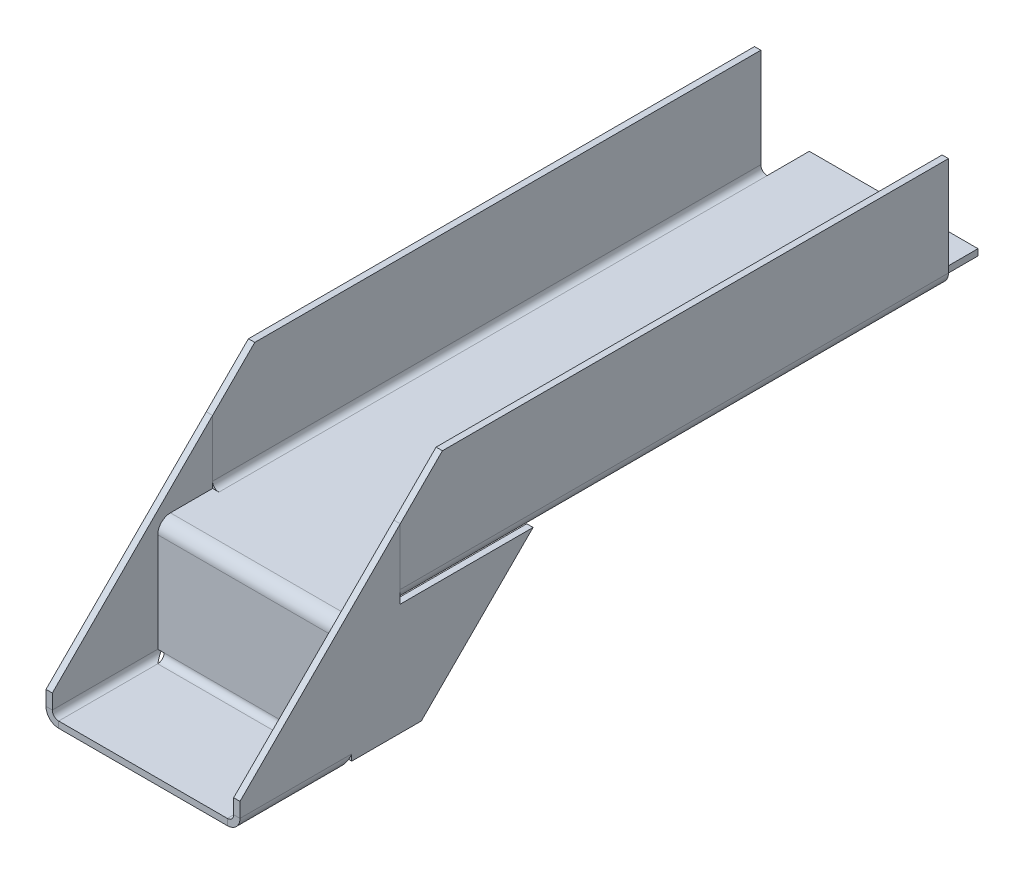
ISO-10303-21;
HEADER;
FILE_DESCRIPTION(('STEP AP214'),'2;1');
FILE_NAME('part.step','',(''),(''),'','','');
FILE_SCHEMA(('AUTOMOTIVE_DESIGN { 1 0 10303 214 1 1 1 1 }'));
ENDSEC;
DATA;
#1=APPLICATION_CONTEXT('core data for automotive mechanical design processes');
#2=APPLICATION_PROTOCOL_DEFINITION('international standard','automotive_design',2000,#1);
#3=PRODUCT_CONTEXT('',#1,'mechanical');
#4=PRODUCT('Part','Part','',(#3));
#5=PRODUCT_RELATED_PRODUCT_CATEGORY('part','',(#4));
#6=PRODUCT_DEFINITION_FORMATION('','',#4);
#7=PRODUCT_DEFINITION_CONTEXT('part definition',#1,'design');
#8=PRODUCT_DEFINITION('design','',#6,#7);
#9=PRODUCT_DEFINITION_SHAPE('','',#8);
#10=(LENGTH_UNIT() NAMED_UNIT(*) SI_UNIT(.MILLI.,.METRE.));
#11=(NAMED_UNIT(*) PLANE_ANGLE_UNIT() SI_UNIT($,.RADIAN.));
#12=(NAMED_UNIT(*) SI_UNIT($,.STERADIAN.) SOLID_ANGLE_UNIT());
#13=UNCERTAINTY_MEASURE_WITH_UNIT(LENGTH_MEASURE(1.E-05),#10,'distance_accuracy_value','');
#14=(GEOMETRIC_REPRESENTATION_CONTEXT(3) GLOBAL_UNCERTAINTY_ASSIGNED_CONTEXT((#13)) GLOBAL_UNIT_ASSIGNED_CONTEXT((#10,
#11,#12)) REPRESENTATION_CONTEXT('',''));
#15=CARTESIAN_POINT('',(0.,0.,0.));
#16=DIRECTION('',(0.,0.,1.));
#17=DIRECTION('',(1.,0.,0.));
#18=AXIS2_PLACEMENT_3D('',#15,#16,#17);
#19=CARTESIAN_POINT('',(-40.0000000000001,-50.,156.));
#20=DIRECTION('',(0.,-1.,0.));
#21=DIRECTION('',(0.,0.,-1.));
#22=AXIS2_PLACEMENT_3D('',#19,#20,#21);
#23=PLANE('',#22);
#24=DIRECTION('',(0.,0.,-1.));
#25=VECTOR('',#24,1.);
#26=CARTESIAN_POINT('',(-40.0000000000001,-50.,156.));
#27=LINE('',#26,#25);
#28=CARTESIAN_POINT('',(-40.0000000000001,-50.,156.));
#29=VERTEX_POINT('',#28);
#30=CARTESIAN_POINT('',(-40.0000000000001,-50.,153.));
#31=VERTEX_POINT('',#30);
#32=EDGE_CURVE('E13',#29,#31,#27,.T.);
#33=ORIENTED_EDGE('',*,*,#32,.F.);
#34=DIRECTION('',(1.,0.,0.));
#35=VECTOR('',#34,1.);
#36=CARTESIAN_POINT('',(-42.9999,-50.,156.));
#37=LINE('',#36,#35);
#38=CARTESIAN_POINT('',(-42.9999,-50.,156.));
#39=VERTEX_POINT('',#38);
#40=EDGE_CURVE('E838',#39,#29,#37,.T.);
#41=ORIENTED_EDGE('',*,*,#40,.F.);
#42=DIRECTION('',(0.,0.,-1.));
#43=VECTOR('',#42,1.);
#44=CARTESIAN_POINT('',(-42.9999,-50.,156.));
#45=LINE('',#44,#43);
#46=CARTESIAN_POINT('',(-42.9999,-50.,153.));
#47=VERTEX_POINT('',#46);
#48=EDGE_CURVE('E847',#39,#47,#45,.T.);
#49=ORIENTED_EDGE('',*,*,#48,.T.);
#50=DIRECTION('',(-1.,0.,0.));
#51=VECTOR('',#50,1.);
#52=CARTESIAN_POINT('',(42.9999000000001,-50.,153.));
#53=LINE('',#52,#51);
#54=EDGE_CURVE('E829',#47,#31,#53,.F.);
#55=ORIENTED_EDGE('',*,*,#54,.T.);
#56=EDGE_LOOP('',(#33,#41,#49,#55));
#57=FACE_BOUND('',#56,.T.);
#58=ADVANCED_FACE('F201',(#57),#23,.T.);
#59=CARTESIAN_POINT('',(42.9999000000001,-50.,159.));
#60=DIRECTION('',(1.,0.,0.));
#61=DIRECTION('',(0.,-1.,0.));
#62=AXIS2_PLACEMENT_3D('',#59,#60,#61);
#63=CYLINDRICAL_SURFACE('',#62,6.00000000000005);
#64=DIRECTION('',(1.,0.,0.));
#65=VECTOR('',#64,1.);
#66=CARTESIAN_POINT('',(-42.9999,-56.,159.));
#67=LINE('',#66,#65);
#68=CARTESIAN_POINT('',(40.0000000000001,-56.,159.));
#69=VERTEX_POINT('',#68);
#70=CARTESIAN_POINT('',(-40.0000000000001,-56.,159.));
#71=VERTEX_POINT('',#70);
#72=EDGE_CURVE('E852',#69,#71,#67,.F.);
#73=ORIENTED_EDGE('',*,*,#72,.T.);
#74=CARTESIAN_POINT('',(-40.0000000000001,-49.9999999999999,159.));
#75=DIRECTION('',(-1.,0.,0.));
#76=DIRECTION('',(0.,0.,1.));
#77=AXIS2_PLACEMENT_3D('',#74,#75,#76);
#78=CIRCLE('',#77,6.00000000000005);
#79=EDGE_CURVE('E208',#71,#31,#78,.F.);
#80=ORIENTED_EDGE('',*,*,#79,.T.);
#81=CARTESIAN_POINT('',(40.0000000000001,-50.,153.));
#82=VERTEX_POINT('',#81);
#83=EDGE_CURVE('E822',#31,#82,#53,.F.);
#84=ORIENTED_EDGE('',*,*,#83,.T.);
#85=CARTESIAN_POINT('',(40.0000000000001,-50.,159.));
#86=DIRECTION('',(1.,0.,0.));
#87=DIRECTION('',(0.,0.,-1.));
#88=AXIS2_PLACEMENT_3D('',#85,#86,#87);
#89=CIRCLE('',#88,6.00000000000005);
#90=EDGE_CURVE('E812',#82,#69,#89,.F.);
#91=ORIENTED_EDGE('',*,*,#90,.T.);
#92=EDGE_LOOP('',(#73,#80,#84,#91));
#93=FACE_BOUND('',#92,.T.);
#94=ADVANCED_FACE('F615',(#93),#63,.T.);
#95=CARTESIAN_POINT('',(-40.0000000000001,-49.9999999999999,159.));
#96=DIRECTION('',(-1.,0.,0.));
#97=DIRECTION('',(0.,0.,1.));
#98=AXIS2_PLACEMENT_3D('',#95,#96,#97);
#99=PLANE('',#98);
#100=CARTESIAN_POINT('',(-40.0000000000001,-49.9999999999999,159.));
#101=DIRECTION('',(-1.,0.,0.));
#102=DIRECTION('',(0.,0.,1.));
#103=AXIS2_PLACEMENT_3D('',#100,#101,#102);
#104=CIRCLE('',#103,3.00000000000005);
#105=CARTESIAN_POINT('',(-40.0000000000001,-53.,159.));
#106=VERTEX_POINT('',#105);
#107=EDGE_CURVE('E808',#106,#29,#104,.F.);
#108=ORIENTED_EDGE('',*,*,#107,.T.);
#109=ORIENTED_EDGE('',*,*,#32,.T.);
#110=ORIENTED_EDGE('',*,*,#79,.F.);
#111=DIRECTION('',(0.,-1.,0.));
#112=VECTOR('',#111,1.);
#113=CARTESIAN_POINT('',(-40.0000000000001,-53.,159.));
#114=LINE('',#113,#112);
#115=EDGE_CURVE('E575',#106,#71,#114,.T.);
#116=ORIENTED_EDGE('',*,*,#115,.F.);
#117=EDGE_LOOP('',(#108,#109,#110,#116));
#118=FACE_BOUND('',#117,.T.);
#119=ADVANCED_FACE('F619',(#118),#99,.T.);
#120=CARTESIAN_POINT('',(-42.9999,-56.,206.));
#121=DIRECTION('',(0.,1.,0.));
#122=DIRECTION('',(0.,0.,1.));
#123=AXIS2_PLACEMENT_3D('',#120,#121,#122);
#124=PLANE('',#123);
#125=DIRECTION('',(0.,0.,1.));
#126=VECTOR('',#125,1.);
#127=CARTESIAN_POINT('',(-40.0000000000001,-56.0000000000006,206.));
#128=LINE('',#127,#126);
#129=CARTESIAN_POINT('',(-40.0000000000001,-56.0000000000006,206.));
#130=VERTEX_POINT('',#129);
#131=EDGE_CURVE('E560',#130,#71,#128,.F.);
#132=ORIENTED_EDGE('',*,*,#131,.T.);
#133=ORIENTED_EDGE('',*,*,#72,.F.);
#134=DIRECTION('',(0.,0.,-1.));
#135=VECTOR('',#134,1.);
#136=CARTESIAN_POINT('',(40.0000000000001,-56.,153.));
#137=LINE('',#136,#135);
#138=CARTESIAN_POINT('',(40.0000000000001,-56.,206.));
#139=VERTEX_POINT('',#138);
#140=EDGE_CURVE('E903',#69,#139,#137,.F.);
#141=ORIENTED_EDGE('',*,*,#140,.T.);
#142=DIRECTION('',(-1.,0.,0.));
#143=VECTOR('',#142,1.);
#144=CARTESIAN_POINT('',(-42.9999,-56.,206.));
#145=LINE('',#144,#143);
#146=EDGE_CURVE('E858',#139,#130,#145,.T.);
#147=ORIENTED_EDGE('',*,*,#146,.T.);
#148=EDGE_LOOP('',(#132,#133,#141,#147));
#149=FACE_BOUND('',#148,.T.);
#150=ADVANCED_FACE('F625',(#149),#124,.F.);
#151=CARTESIAN_POINT('',(-42.9999,-53.,206.));
#152=DIRECTION('',(0.,1.,0.));
#153=DIRECTION('',(0.,0.,1.));
#154=AXIS2_PLACEMENT_3D('',#151,#152,#153);
#155=PLANE('',#154);
#156=DIRECTION('',(1.,0.,0.));
#157=VECTOR('',#156,1.);
#158=CARTESIAN_POINT('',(-42.9999,-53.,159.));
#159=LINE('',#158,#157);
#160=CARTESIAN_POINT('',(40.0000000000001,-53.,159.));
#161=VERTEX_POINT('',#160);
#162=EDGE_CURVE('E850',#106,#161,#159,.T.);
#163=ORIENTED_EDGE('',*,*,#162,.F.);
#164=DIRECTION('',(0.,0.,1.));
#165=VECTOR('',#164,1.);
#166=CARTESIAN_POINT('',(-40.0000000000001,-53.0000000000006,206.));
#167=LINE('',#166,#165);
#168=CARTESIAN_POINT('',(-40.0000000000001,-53.,206.));
#169=VERTEX_POINT('',#168);
#170=EDGE_CURVE('E565',#169,#106,#167,.F.);
#171=ORIENTED_EDGE('',*,*,#170,.F.);
#172=DIRECTION('',(1.,0.,0.));
#173=VECTOR('',#172,1.);
#174=CARTESIAN_POINT('',(-42.9999,-53.,206.));
#175=LINE('',#174,#173);
#176=CARTESIAN_POINT('',(40.0000000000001,-53.,206.));
#177=VERTEX_POINT('',#176);
#178=EDGE_CURVE('E855',#177,#169,#175,.F.);
#179=ORIENTED_EDGE('',*,*,#178,.F.);
#180=DIRECTION('',(0.,0.,-1.));
#181=VECTOR('',#180,1.);
#182=CARTESIAN_POINT('',(40.0000000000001,-53.,153.));
#183=LINE('',#182,#181);
#184=EDGE_CURVE('E869',#161,#177,#183,.F.);
#185=ORIENTED_EDGE('',*,*,#184,.F.);
#186=EDGE_LOOP('',(#163,#171,#179,#185));
#187=FACE_BOUND('',#186,.T.);
#188=ADVANCED_FACE('F794',(#187),#155,.T.);
#189=CARTESIAN_POINT('',(-42.9999,-56.,206.));
#190=DIRECTION('',(0.,0.,-1.));
#191=DIRECTION('',(0.,1.,0.));
#192=AXIS2_PLACEMENT_3D('',#189,#190,#191);
#193=PLANE('',#192);
#194=DIRECTION('',(0.,-1.,0.));
#195=VECTOR('',#194,1.);
#196=CARTESIAN_POINT('',(-40.0000000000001,-53.0000000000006,206.));
#197=LINE('',#196,#195);
#198=EDGE_CURVE('E572',#169,#130,#197,.T.);
#199=ORIENTED_EDGE('',*,*,#198,.T.);
#200=ORIENTED_EDGE('',*,*,#146,.F.);
#201=DIRECTION('',(0.,-1.,0.));
#202=VECTOR('',#201,1.);
#203=CARTESIAN_POINT('',(40.0000000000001,-53.0000000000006,206.));
#204=LINE('',#203,#202);
#205=EDGE_CURVE('E853',#177,#139,#204,.T.);
#206=ORIENTED_EDGE('',*,*,#205,.F.);
#207=ORIENTED_EDGE('',*,*,#178,.T.);
#208=EDGE_LOOP('',(#199,#200,#206,#207));
#209=FACE_BOUND('',#208,.T.);
#210=ADVANCED_FACE('F629',(#209),#193,.F.);
#211=CARTESIAN_POINT('',(40.0000000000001,-50.,153.));
#212=DIRECTION('',(0.,-1.,0.));
#213=DIRECTION('',(0.,0.,-1.));
#214=AXIS2_PLACEMENT_3D('',#211,#212,#213);
#215=PLANE('',#214);
#216=DIRECTION('',(0.,0.,1.));
#217=VECTOR('',#216,1.);
#218=CARTESIAN_POINT('',(40.0000000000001,-50.,153.));
#219=LINE('',#218,#217);
#220=CARTESIAN_POINT('',(40.0000000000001,-50.,156.));
#221=VERTEX_POINT('',#220);
#222=EDGE_CURVE('E799',#82,#221,#219,.T.);
#223=ORIENTED_EDGE('',*,*,#222,.F.);
#224=CARTESIAN_POINT('',(42.9999000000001,-50.,153.));
#225=VERTEX_POINT('',#224);
#226=EDGE_CURVE('E803',#82,#225,#53,.F.);
#227=ORIENTED_EDGE('',*,*,#226,.T.);
#228=DIRECTION('',(0.,0.,-1.));
#229=VECTOR('',#228,1.);
#230=CARTESIAN_POINT('',(42.9999000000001,-50.,156.));
#231=LINE('',#230,#229);
#232=CARTESIAN_POINT('',(42.9999000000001,-50.,156.));
#233=VERTEX_POINT('',#232);
#234=EDGE_CURVE('E845',#233,#225,#231,.T.);
#235=ORIENTED_EDGE('',*,*,#234,.F.);
#236=EDGE_CURVE('E805',#221,#233,#37,.T.);
#237=ORIENTED_EDGE('',*,*,#236,.F.);
#238=EDGE_LOOP('',(#223,#227,#235,#237));
#239=FACE_BOUND('',#238,.T.);
#240=ADVANCED_FACE('F776',(#239),#215,.T.);
#241=CARTESIAN_POINT('',(-40.,3.,130.));
#242=DIRECTION('',(1.,0.,0.));
#243=DIRECTION('',(0.,0.,-1.));
#244=AXIS2_PLACEMENT_3D('',#241,#242,#243);
#245=PLANE('',#244);
#246=DIRECTION('',(0.,-1.,0.));
#247=VECTOR('',#246,1.);
#248=CARTESIAN_POINT('',(-40.,3.00000000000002,-130.));
#249=LINE('',#248,#247);
#250=CARTESIAN_POINT('',(-40.,3.,-130.));
#251=VERTEX_POINT('',#250);
#252=CARTESIAN_POINT('',(-40.,0.,-130.));
#253=VERTEX_POINT('',#252);
#254=EDGE_CURVE('E1140',#251,#253,#249,.T.);
#255=ORIENTED_EDGE('',*,*,#254,.F.);
#256=DIRECTION('',(0.,0.,1.));
#257=VECTOR('',#256,1.);
#258=CARTESIAN_POINT('',(-40.,3.,130.));
#259=LINE('',#258,#257);
#260=CARTESIAN_POINT('',(-40.,3.,-150.));
#261=VERTEX_POINT('',#260);
#262=EDGE_CURVE('E1146',#261,#251,#259,.T.);
#263=ORIENTED_EDGE('',*,*,#262,.F.);
#264=DIRECTION('',(0.,-1.,0.));
#265=VECTOR('',#264,1.);
#266=CARTESIAN_POINT('',(-40.,3.,-150.));
#267=LINE('',#266,#265);
#268=CARTESIAN_POINT('',(-40.,0.,-150.));
#269=VERTEX_POINT('',#268);
#270=EDGE_CURVE('E1177',#261,#269,#267,.T.);
#271=ORIENTED_EDGE('',*,*,#270,.T.);
#272=DIRECTION('',(0.,0.,1.));
#273=VECTOR('',#272,1.);
#274=CARTESIAN_POINT('',(-40.,0.,130.));
#275=LINE('',#274,#273);
#276=EDGE_CURVE('E1144',#269,#253,#275,.T.);
#277=ORIENTED_EDGE('',*,*,#276,.T.);
#278=EDGE_LOOP('',(#255,#263,#271,#277));
#279=FACE_BOUND('',#278,.T.);
#280=ADVANCED_FACE('F772',(#279),#245,.F.);
#281=CARTESIAN_POINT('',(-40.,3.,130.));
#282=DIRECTION('',(0.,0.,1.));
#283=DIRECTION('',(1.,0.,0.));
#284=AXIS2_PLACEMENT_3D('',#281,#282,#283);
#285=PLANE('',#284);
#286=DIRECTION('',(-1.,0.,0.));
#287=VECTOR('',#286,1.);
#288=CARTESIAN_POINT('',(-40.,0.,130.));
#289=LINE('',#288,#287);
#290=CARTESIAN_POINT('',(-40.,0.,130.));
#291=VERTEX_POINT('',#290);
#292=CARTESIAN_POINT('',(-42.9999,0.,130.));
#293=VERTEX_POINT('',#292);
#294=EDGE_CURVE('E1199',#291,#293,#289,.T.);
#295=ORIENTED_EDGE('',*,*,#294,.T.);
#296=DIRECTION('',(0.,-1.,0.));
#297=VECTOR('',#296,1.);
#298=CARTESIAN_POINT('',(-42.9999,3.,130.));
#299=LINE('',#298,#297);
#300=CARTESIAN_POINT('',(-42.9999,3.,130.));
#301=VERTEX_POINT('',#300);
#302=EDGE_CURVE('E1194',#301,#293,#299,.T.);
#303=ORIENTED_EDGE('',*,*,#302,.F.);
#304=DIRECTION('',(-1.,0.,0.));
#305=VECTOR('',#304,1.);
#306=CARTESIAN_POINT('',(-40.,3.,130.));
#307=LINE('',#306,#305);
#308=CARTESIAN_POINT('',(-40.,3.,130.));
#309=VERTEX_POINT('',#308);
#310=EDGE_CURVE('E1263',#309,#301,#307,.T.);
#311=ORIENTED_EDGE('',*,*,#310,.F.);
#312=DIRECTION('',(0.,-1.,0.));
#313=VECTOR('',#312,1.);
#314=CARTESIAN_POINT('',(-40.,3.,130.));
#315=LINE('',#314,#313);
#316=EDGE_CURVE('E1078',#309,#291,#315,.T.);
#317=ORIENTED_EDGE('',*,*,#316,.T.);
#318=EDGE_LOOP('',(#295,#303,#311,#317));
#319=FACE_BOUND('',#318,.T.);
#320=ADVANCED_FACE('F768',(#319),#285,.F.);
#321=CARTESIAN_POINT('',(-42.9999,3.,130.));
#322=DIRECTION('',(1.,0.,0.));
#323=DIRECTION('',(0.,0.,-1.));
#324=AXIS2_PLACEMENT_3D('',#321,#322,#323);
#325=PLANE('',#324);
#326=DIRECTION('',(0.,0.,1.));
#327=VECTOR('',#326,1.);
#328=CARTESIAN_POINT('',(-42.9999,0.,130.));
#329=LINE('',#328,#327);
#330=CARTESIAN_POINT('',(-42.9999,0.,150.));
#331=VERTEX_POINT('',#330);
#332=EDGE_CURVE('E1205',#293,#331,#329,.T.);
#333=ORIENTED_EDGE('',*,*,#332,.T.);
#334=DIRECTION('',(0.,-1.,0.));
#335=VECTOR('',#334,1.);
#336=CARTESIAN_POINT('',(-42.9999,3.,150.));
#337=LINE('',#336,#335);
#338=CARTESIAN_POINT('',(-42.9999,3.,150.));
#339=VERTEX_POINT('',#338);
#340=EDGE_CURVE('E1192',#339,#331,#337,.T.);
#341=ORIENTED_EDGE('',*,*,#340,.F.);
#342=DIRECTION('',(0.,0.,1.));
#343=VECTOR('',#342,1.);
#344=CARTESIAN_POINT('',(-42.9999,3.,130.));
#345=LINE('',#344,#343);
#346=EDGE_CURVE('E1261',#301,#339,#345,.T.);
#347=ORIENTED_EDGE('',*,*,#346,.F.);
#348=ORIENTED_EDGE('',*,*,#302,.T.);
#349=EDGE_LOOP('',(#333,#341,#347,#348));
#350=FACE_BOUND('',#349,.T.);
#351=ADVANCED_FACE('F764',(#350),#325,.F.);
#352=CARTESIAN_POINT('',(42.9999000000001,3.,130.));
#353=DIRECTION('',(-1.,0.,0.));
#354=DIRECTION('',(0.,0.,1.));
#355=AXIS2_PLACEMENT_3D('',#352,#353,#354);
#356=PLANE('',#355);
#357=DIRECTION('',(0.,0.,-1.));
#358=VECTOR('',#357,1.);
#359=CARTESIAN_POINT('',(42.9999000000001,0.,130.));
#360=LINE('',#359,#358);
#361=CARTESIAN_POINT('',(42.9999000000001,0.,150.));
#362=VERTEX_POINT('',#361);
#363=CARTESIAN_POINT('',(42.9999000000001,0.,130.));
#364=VERTEX_POINT('',#363);
#365=EDGE_CURVE('E1209',#362,#364,#360,.T.);
#366=ORIENTED_EDGE('',*,*,#365,.T.);
#367=DIRECTION('',(0.,-1.,0.));
#368=VECTOR('',#367,1.);
#369=CARTESIAN_POINT('',(42.9999000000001,3.,130.));
#370=LINE('',#369,#368);
#371=CARTESIAN_POINT('',(42.9999000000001,3.,130.));
#372=VERTEX_POINT('',#371);
#373=EDGE_CURVE('E1186',#372,#364,#370,.T.);
#374=ORIENTED_EDGE('',*,*,#373,.F.);
#375=DIRECTION('',(0.,0.,-1.));
#376=VECTOR('',#375,1.);
#377=CARTESIAN_POINT('',(42.9999000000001,3.,130.));
#378=LINE('',#377,#376);
#379=CARTESIAN_POINT('',(42.9999000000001,3.,150.));
#380=VERTEX_POINT('',#379);
#381=EDGE_CURVE('E1256',#380,#372,#378,.T.);
#382=ORIENTED_EDGE('',*,*,#381,.F.);
#383=DIRECTION('',(0.,-1.,0.));
#384=VECTOR('',#383,1.);
#385=CARTESIAN_POINT('',(42.9999000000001,3.,150.));
#386=LINE('',#385,#384);
#387=EDGE_CURVE('E1189',#380,#362,#386,.T.);
#388=ORIENTED_EDGE('',*,*,#387,.T.);
#389=EDGE_LOOP('',(#366,#374,#382,#388));
#390=FACE_BOUND('',#389,.T.);
#391=ADVANCED_FACE('F760',(#390),#356,.F.);
#392=CARTESIAN_POINT('',(40.0000000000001,3.,130.));
#393=DIRECTION('',(0.,0.,1.));
#394=DIRECTION('',(1.,0.,0.));
#395=AXIS2_PLACEMENT_3D('',#392,#393,#394);
#396=PLANE('',#395);
#397=DIRECTION('',(-1.,0.,0.));
#398=VECTOR('',#397,1.);
#399=CARTESIAN_POINT('',(40.0000000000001,0.,130.));
#400=LINE('',#399,#398);
#401=CARTESIAN_POINT('',(40.,0.,130.));
#402=VERTEX_POINT('',#401);
#403=EDGE_CURVE('E1168',#364,#402,#400,.T.);
#404=ORIENTED_EDGE('',*,*,#403,.T.);
#405=DIRECTION('',(0.,-1.,0.));
#406=VECTOR('',#405,1.);
#407=CARTESIAN_POINT('',(40.0000000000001,3.,130.));
#408=LINE('',#407,#406);
#409=CARTESIAN_POINT('',(40.,2.99999999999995,130.));
#410=VERTEX_POINT('',#409);
#411=EDGE_CURVE('E1184',#410,#402,#408,.T.);
#412=ORIENTED_EDGE('',*,*,#411,.F.);
#413=DIRECTION('',(-1.,0.,0.));
#414=VECTOR('',#413,1.);
#415=CARTESIAN_POINT('',(40.0000000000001,3.,130.));
#416=LINE('',#415,#414);
#417=EDGE_CURVE('E1252',#372,#410,#416,.T.);
#418=ORIENTED_EDGE('',*,*,#417,.F.);
#419=ORIENTED_EDGE('',*,*,#373,.T.);
#420=EDGE_LOOP('',(#404,#412,#418,#419));
#421=FACE_BOUND('',#420,.T.);
#422=ADVANCED_FACE('F756',(#421),#396,.F.);
#423=CARTESIAN_POINT('',(40.0000000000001,3.,130.));
#424=DIRECTION('',(-1.,0.,0.));
#425=DIRECTION('',(0.,0.,1.));
#426=AXIS2_PLACEMENT_3D('',#423,#424,#425);
#427=PLANE('',#426);
#428=DIRECTION('',(0.,0.,-1.));
#429=VECTOR('',#428,1.);
#430=CARTESIAN_POINT('',(40.0000000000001,3.,130.));
#431=LINE('',#430,#429);
#432=CARTESIAN_POINT('',(40.,3.00000000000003,-130.));
#433=VERTEX_POINT('',#432);
#434=CARTESIAN_POINT('',(40.,3.,-150.));
#435=VERTEX_POINT('',#434);
#436=EDGE_CURVE('E1228',#433,#435,#431,.T.);
#437=ORIENTED_EDGE('',*,*,#436,.F.);
#438=DIRECTION('',(0.,-1.,0.));
#439=VECTOR('',#438,1.);
#440=CARTESIAN_POINT('',(40.,3.00000000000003,-130.));
#441=LINE('',#440,#439);
#442=CARTESIAN_POINT('',(40.,0.,-130.));
#443=VERTEX_POINT('',#442);
#444=EDGE_CURVE('E1086',#433,#443,#441,.T.);
#445=ORIENTED_EDGE('',*,*,#444,.T.);
#446=DIRECTION('',(0.,0.,-1.));
#447=VECTOR('',#446,1.);
#448=CARTESIAN_POINT('',(40.0000000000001,0.,130.));
#449=LINE('',#448,#447);
#450=CARTESIAN_POINT('',(40.,0.,-150.));
#451=VERTEX_POINT('',#450);
#452=EDGE_CURVE('E1164',#443,#451,#449,.T.);
#453=ORIENTED_EDGE('',*,*,#452,.T.);
#454=DIRECTION('',(0.,-1.,0.));
#455=VECTOR('',#454,1.);
#456=CARTESIAN_POINT('',(40.,3.,-150.));
#457=LINE('',#456,#455);
#458=EDGE_CURVE('E1180',#435,#451,#457,.T.);
#459=ORIENTED_EDGE('',*,*,#458,.F.);
#460=EDGE_LOOP('',(#437,#445,#453,#459));
#461=FACE_BOUND('',#460,.T.);
#462=ADVANCED_FACE('F752',(#461),#427,.F.);
#463=CARTESIAN_POINT('',(40.,3.,-150.));
#464=DIRECTION('',(0.,0.,1.));
#465=DIRECTION('',(1.,0.,0.));
#466=AXIS2_PLACEMENT_3D('',#463,#464,#465);
#467=PLANE('',#466);
#468=DIRECTION('',(-1.,0.,0.));
#469=VECTOR('',#468,1.);
#470=CARTESIAN_POINT('',(40.,0.,-150.));
#471=LINE('',#470,#469);
#472=EDGE_CURVE('E1174',#451,#269,#471,.T.);
#473=ORIENTED_EDGE('',*,*,#472,.T.);
#474=ORIENTED_EDGE('',*,*,#270,.F.);
#475=DIRECTION('',(-1.,0.,0.));
#476=VECTOR('',#475,1.);
#477=CARTESIAN_POINT('',(40.,3.,-150.));
#478=LINE('',#477,#476);
#479=EDGE_CURVE('E1181',#435,#261,#478,.T.);
#480=ORIENTED_EDGE('',*,*,#479,.F.);
#481=ORIENTED_EDGE('',*,*,#458,.T.);
#482=EDGE_LOOP('',(#473,#474,#480,#481));
#483=FACE_BOUND('',#482,.T.);
#484=ADVANCED_FACE('F745',(#483),#467,.F.);
#485=CARTESIAN_POINT('',(-40.,3.,-150.));
#486=DIRECTION('',(0.,1.,0.));
#487=DIRECTION('',(0.,0.,1.));
#488=AXIS2_PLACEMENT_3D('',#485,#486,#487);
#489=PLANE('',#488);
#490=ORIENTED_EDGE('',*,*,#262,.T.);
#491=DIRECTION('',(0.,0.,1.));
#492=VECTOR('',#491,1.);
#493=CARTESIAN_POINT('',(-40.,3.00000000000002,130.));
#494=LINE('',#493,#492);
#495=EDGE_CURVE('E1134',#309,#251,#494,.F.);
#496=ORIENTED_EDGE('',*,*,#495,.F.);
#497=ORIENTED_EDGE('',*,*,#310,.T.);
#498=ORIENTED_EDGE('',*,*,#346,.T.);
#499=DIRECTION('',(1.,0.,0.));
#500=VECTOR('',#499,1.);
#501=CARTESIAN_POINT('',(-42.9999,3.,150.));
#502=LINE('',#501,#500);
#503=EDGE_CURVE('E1258',#339,#380,#502,.T.);
#504=ORIENTED_EDGE('',*,*,#503,.T.);
#505=ORIENTED_EDGE('',*,*,#381,.T.);
#506=ORIENTED_EDGE('',*,*,#417,.T.);
#507=EDGE_CURVE('E1233',#410,#433,#431,.T.);
#508=ORIENTED_EDGE('',*,*,#507,.T.);
#509=ORIENTED_EDGE('',*,*,#436,.T.);
#510=ORIENTED_EDGE('',*,*,#479,.T.);
#511=EDGE_LOOP('',(#490,#496,#497,#498,#504,#505,#506,#508,#509,#510));
#512=FACE_BOUND('',#511,.T.);
#513=ADVANCED_FACE('F742',(#512),#489,.T.);
#514=CARTESIAN_POINT('',(-40.,0.,-150.));
#515=DIRECTION('',(0.,1.,0.));
#516=DIRECTION('',(0.,0.,1.));
#517=AXIS2_PLACEMENT_3D('',#514,#515,#516);
#518=PLANE('',#517);
#519=ORIENTED_EDGE('',*,*,#276,.F.);
#520=ORIENTED_EDGE('',*,*,#472,.F.);
#521=ORIENTED_EDGE('',*,*,#452,.F.);
#522=EDGE_CURVE('E1167',#402,#443,#449,.T.);
#523=ORIENTED_EDGE('',*,*,#522,.F.);
#524=ORIENTED_EDGE('',*,*,#403,.F.);
#525=ORIENTED_EDGE('',*,*,#365,.F.);
#526=DIRECTION('',(1.,0.,0.));
#527=VECTOR('',#526,1.);
#528=CARTESIAN_POINT('',(42.9999000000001,0.,150.));
#529=LINE('',#528,#527);
#530=EDGE_CURVE('E1208',#331,#362,#529,.T.);
#531=ORIENTED_EDGE('',*,*,#530,.F.);
#532=ORIENTED_EDGE('',*,*,#332,.F.);
#533=ORIENTED_EDGE('',*,*,#294,.F.);
#534=DIRECTION('',(0.,0.,1.));
#535=VECTOR('',#534,1.);
#536=CARTESIAN_POINT('',(-40.,0.,130.));
#537=LINE('',#536,#535);
#538=EDGE_CURVE('E1130',#291,#253,#537,.F.);
#539=ORIENTED_EDGE('',*,*,#538,.T.);
#540=EDGE_LOOP('',(#519,#520,#521,#523,#524,#525,#531,#532,#533,#539));
#541=FACE_BOUND('',#540,.T.);
#542=ADVANCED_FACE('F737',(#541),#518,.F.);
#543=CARTESIAN_POINT('',(-40.,6.00000000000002,-130.));
#544=DIRECTION('',(0.,0.,-1.));
#545=DIRECTION('',(-1.,0.,0.));
#546=AXIS2_PLACEMENT_3D('',#543,#544,#545);
#547=PLANE('',#546);
#548=DIRECTION('',(1.,0.,0.));
#549=VECTOR('',#548,1.);
#550=CARTESIAN_POINT('',(-46.,5.99999999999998,-130.));
#551=LINE('',#550,#549);
#552=CARTESIAN_POINT('',(-43.,6.00000000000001,-130.));
#553=VERTEX_POINT('',#552);
#554=CARTESIAN_POINT('',(-46.,6.,-130.));
#555=VERTEX_POINT('',#554);
#556=EDGE_CURVE('E1090',#553,#555,#551,.F.);
#557=ORIENTED_EDGE('',*,*,#556,.F.);
#558=CARTESIAN_POINT('',(-40.,6.00000000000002,-130.));
#559=DIRECTION('',(0.,0.,1.));
#560=DIRECTION('',(1.,0.,0.));
#561=AXIS2_PLACEMENT_3D('',#558,#559,#560);
#562=CIRCLE('',#561,3.);
#563=EDGE_CURVE('E1131',#251,#553,#562,.F.);
#564=ORIENTED_EDGE('',*,*,#563,.F.);
#565=ORIENTED_EDGE('',*,*,#254,.T.);
#566=CARTESIAN_POINT('',(-40.,6.00000000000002,-130.));
#567=DIRECTION('',(0.,0.,1.));
#568=DIRECTION('',(1.,0.,0.));
#569=AXIS2_PLACEMENT_3D('',#566,#567,#568);
#570=CIRCLE('',#569,6.);
#571=EDGE_CURVE('E1145',#253,#555,#570,.F.);
#572=ORIENTED_EDGE('',*,*,#571,.T.);
#573=EDGE_LOOP('',(#557,#564,#565,#572));
#574=FACE_BOUND('',#573,.T.);
#575=ADVANCED_FACE('F731',(#574),#547,.T.);
#576=CARTESIAN_POINT('',(-40.,6.00000000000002,130.));
#577=DIRECTION('',(0.,0.,-1.));
#578=DIRECTION('',(-1.,0.,0.));
#579=AXIS2_PLACEMENT_3D('',#576,#577,#578);
#580=PLANE('',#579);
#581=CARTESIAN_POINT('',(-40.,6.00000000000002,130.));
#582=DIRECTION('',(0.,0.,1.));
#583=DIRECTION('',(1.,0.,0.));
#584=AXIS2_PLACEMENT_3D('',#581,#582,#583);
#585=CIRCLE('',#584,3.);
#586=CARTESIAN_POINT('',(-43.,6.00000000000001,130.));
#587=VERTEX_POINT('',#586);
#588=EDGE_CURVE('E1101',#587,#309,#585,.T.);
#589=ORIENTED_EDGE('',*,*,#588,.F.);
#590=DIRECTION('',(1.,0.,0.));
#591=VECTOR('',#590,1.);
#592=CARTESIAN_POINT('',(-43.,6.00000000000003,130.));
#593=LINE('',#592,#591);
#594=CARTESIAN_POINT('',(-46.,6.00000000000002,130.));
#595=VERTEX_POINT('',#594);
#596=EDGE_CURVE('E1120',#587,#595,#593,.F.);
#597=ORIENTED_EDGE('',*,*,#596,.T.);
#598=CARTESIAN_POINT('',(-40.,6.00000000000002,130.));
#599=DIRECTION('',(0.,0.,1.));
#600=DIRECTION('',(1.,0.,0.));
#601=AXIS2_PLACEMENT_3D('',#598,#599,#600);
#602=CIRCLE('',#601,6.);
#603=EDGE_CURVE('E1127',#595,#291,#602,.T.);
#604=ORIENTED_EDGE('',*,*,#603,.T.);
#605=ORIENTED_EDGE('',*,*,#316,.F.);
#606=EDGE_LOOP('',(#589,#597,#604,#605));
#607=FACE_BOUND('',#606,.T.);
#608=ADVANCED_FACE('F729',(#607),#580,.F.);
#609=CARTESIAN_POINT('',(-40.,6.00000000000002,130.));
#610=DIRECTION('',(0.,0.,1.));
#611=DIRECTION('',(-1.,0.,0.));
#612=AXIS2_PLACEMENT_3D('',#609,#610,#611);
#613=CYLINDRICAL_SURFACE('',#612,6.);
#614=ORIENTED_EDGE('',*,*,#538,.F.);
#615=ORIENTED_EDGE('',*,*,#603,.F.);
#616=DIRECTION('',(0.,0.,1.));
#617=VECTOR('',#616,1.);
#618=CARTESIAN_POINT('',(-46.,5.99999999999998,-130.));
#619=LINE('',#618,#617);
#620=EDGE_CURVE('E1118',#595,#555,#619,.F.);
#621=ORIENTED_EDGE('',*,*,#620,.T.);
#622=ORIENTED_EDGE('',*,*,#571,.F.);
#623=EDGE_LOOP('',(#614,#615,#621,#622));
#624=FACE_BOUND('',#623,.T.);
#625=ADVANCED_FACE('F726',(#624),#613,.T.);
#626=CARTESIAN_POINT('',(-40.,6.00000000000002,130.));
#627=DIRECTION('',(0.,0.,1.));
#628=DIRECTION('',(-1.,0.,0.));
#629=AXIS2_PLACEMENT_3D('',#626,#627,#628);
#630=CYLINDRICAL_SURFACE('',#629,3.);
#631=ORIENTED_EDGE('',*,*,#495,.T.);
#632=ORIENTED_EDGE('',*,*,#563,.T.);
#633=DIRECTION('',(0.,0.,1.));
#634=VECTOR('',#633,1.);
#635=CARTESIAN_POINT('',(-43.,5.99999999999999,-130.));
#636=LINE('',#635,#634);
#637=EDGE_CURVE('E1123',#553,#587,#636,.T.);
#638=ORIENTED_EDGE('',*,*,#637,.T.);
#639=ORIENTED_EDGE('',*,*,#588,.T.);
#640=EDGE_LOOP('',(#631,#632,#638,#639));
#641=FACE_BOUND('',#640,.T.);
#642=ADVANCED_FACE('F724',(#641),#630,.F.);
#643=CARTESIAN_POINT('',(-46.0000000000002,53.,130.));
#644=DIRECTION('',(0.,0.,-1.));
#645=DIRECTION('',(-1.,0.,0.));
#646=AXIS2_PLACEMENT_3D('',#643,#644,#645);
#647=PLANE('',#646);
#648=DIRECTION('',(0.,-1.,0.));
#649=VECTOR('',#648,1.);
#650=CARTESIAN_POINT('',(-43.0000000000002,53.,130.));
#651=LINE('',#650,#649);
#652=CARTESIAN_POINT('',(-43.0000000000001,33.,130.));
#653=VERTEX_POINT('',#652);
#654=EDGE_CURVE('E1115',#587,#653,#651,.F.);
#655=ORIENTED_EDGE('',*,*,#654,.T.);
#656=DIRECTION('',(-1.,0.,0.));
#657=VECTOR('',#656,1.);
#658=CARTESIAN_POINT('',(-46.0000000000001,33.,130.));
#659=LINE('',#658,#657);
#660=CARTESIAN_POINT('',(-46.0000000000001,33.,130.));
#661=VERTEX_POINT('',#660);
#662=EDGE_CURVE('E1062',#653,#661,#659,.T.);
#663=ORIENTED_EDGE('',*,*,#662,.T.);
#664=DIRECTION('',(0.,1.,0.));
#665=VECTOR('',#664,1.);
#666=CARTESIAN_POINT('',(-46.,3.00000000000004,130.));
#667=LINE('',#666,#665);
#668=EDGE_CURVE('E1107',#595,#661,#667,.T.);
#669=ORIENTED_EDGE('',*,*,#668,.F.);
#670=ORIENTED_EDGE('',*,*,#596,.F.);
#671=EDGE_LOOP('',(#655,#663,#669,#670));
#672=FACE_BOUND('',#671,.T.);
#673=ADVANCED_FACE('F717',(#672),#647,.F.);
#674=CARTESIAN_POINT('',(-46.,2.99999999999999,-130.));
#675=DIRECTION('',(0.,0.,1.));
#676=DIRECTION('',(1.,0.,0.));
#677=AXIS2_PLACEMENT_3D('',#674,#675,#676);
#678=PLANE('',#677);
#679=ORIENTED_EDGE('',*,*,#556,.T.);
#680=DIRECTION('',(0.,-1.,0.));
#681=VECTOR('',#680,1.);
#682=CARTESIAN_POINT('',(-46.,3.00000000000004,-130.));
#683=LINE('',#682,#681);
#684=CARTESIAN_POINT('',(-46.0000000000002,53.,-130.));
#685=VERTEX_POINT('',#684);
#686=EDGE_CURVE('E1102',#685,#555,#683,.T.);
#687=ORIENTED_EDGE('',*,*,#686,.F.);
#688=DIRECTION('',(1.,0.,0.));
#689=VECTOR('',#688,1.);
#690=CARTESIAN_POINT('',(-46.0000000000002,53.,-130.));
#691=LINE('',#690,#689);
#692=CARTESIAN_POINT('',(-43.0000000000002,53.,-130.));
#693=VERTEX_POINT('',#692);
#694=EDGE_CURVE('E1098',#685,#693,#691,.T.);
#695=ORIENTED_EDGE('',*,*,#694,.T.);
#696=DIRECTION('',(0.,1.,0.));
#697=VECTOR('',#696,1.);
#698=CARTESIAN_POINT('',(-43.,3.,-130.));
#699=LINE('',#698,#697);
#700=EDGE_CURVE('E1110',#693,#553,#699,.F.);
#701=ORIENTED_EDGE('',*,*,#700,.T.);
#702=EDGE_LOOP('',(#679,#687,#695,#701));
#703=FACE_BOUND('',#702,.T.);
#704=ADVANCED_FACE('F710',(#703),#678,.F.);
#705=CARTESIAN_POINT('',(-46.,3.00000000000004,130.));
#706=DIRECTION('',(1.,0.,0.));
#707=DIRECTION('',(0.,1.,0.));
#708=AXIS2_PLACEMENT_3D('',#705,#706,#707);
#709=PLANE('',#708);
#710=ORIENTED_EDGE('',*,*,#668,.T.);
#711=DIRECTION('',(0.,-0.707106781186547,0.707106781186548));
#712=VECTOR('',#711,1.);
#713=CARTESIAN_POINT('',(-46.0000000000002,53.,110.));
#714=LINE('',#713,#712);
#715=CARTESIAN_POINT('',(-46.0000000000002,53.,110.));
#716=VERTEX_POINT('',#715);
#717=EDGE_CURVE('E817',#661,#716,#714,.F.);
#718=ORIENTED_EDGE('',*,*,#717,.T.);
#719=DIRECTION('',(0.,0.,-1.));
#720=VECTOR('',#719,1.);
#721=CARTESIAN_POINT('',(-46.0000000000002,53.,130.));
#722=LINE('',#721,#720);
#723=EDGE_CURVE('E1105',#716,#685,#722,.T.);
#724=ORIENTED_EDGE('',*,*,#723,.T.);
#725=ORIENTED_EDGE('',*,*,#686,.T.);
#726=ORIENTED_EDGE('',*,*,#620,.F.);
#727=EDGE_LOOP('',(#710,#718,#724,#725,#726));
#728=FACE_BOUND('',#727,.T.);
#729=ADVANCED_FACE('F706',(#728),#709,.F.);
#730=CARTESIAN_POINT('',(-43.,3.00000000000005,130.));
#731=DIRECTION('',(1.,0.,0.));
#732=DIRECTION('',(0.,1.,0.));
#733=AXIS2_PLACEMENT_3D('',#730,#731,#732);
#734=PLANE('',#733);
#735=DIRECTION('',(0.,0.,1.));
#736=VECTOR('',#735,1.);
#737=CARTESIAN_POINT('',(-43.0000000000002,53.,-130.));
#738=LINE('',#737,#736);
#739=CARTESIAN_POINT('',(-43.0000000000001,53.,110.));
#740=VERTEX_POINT('',#739);
#741=EDGE_CURVE('E1113',#740,#693,#738,.F.);
#742=ORIENTED_EDGE('',*,*,#741,.F.);
#743=DIRECTION('',(0.,0.707106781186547,-0.707106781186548));
#744=VECTOR('',#743,1.);
#745=CARTESIAN_POINT('',(-43.,18.,145.));
#746=LINE('',#745,#744);
#747=EDGE_CURVE('E1064',#740,#653,#746,.F.);
#748=ORIENTED_EDGE('',*,*,#747,.T.);
#749=ORIENTED_EDGE('',*,*,#654,.F.);
#750=ORIENTED_EDGE('',*,*,#637,.F.);
#751=ORIENTED_EDGE('',*,*,#700,.F.);
#752=EDGE_LOOP('',(#742,#748,#749,#750,#751));
#753=FACE_BOUND('',#752,.T.);
#754=ADVANCED_FACE('F709',(#753),#734,.T.);
#755=CARTESIAN_POINT('',(-46.0000000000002,53.,-130.));
#756=DIRECTION('',(0.,-1.,0.));
#757=DIRECTION('',(1.,0.,0.));
#758=AXIS2_PLACEMENT_3D('',#755,#756,#757);
#759=PLANE('',#758);
#760=ORIENTED_EDGE('',*,*,#723,.F.);
#761=DIRECTION('',(1.,0.,0.));
#762=VECTOR('',#761,1.);
#763=CARTESIAN_POINT('',(-46.0000000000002,53.,110.));
#764=LINE('',#763,#762);
#765=EDGE_CURVE('E1066',#716,#740,#764,.T.);
#766=ORIENTED_EDGE('',*,*,#765,.T.);
#767=ORIENTED_EDGE('',*,*,#741,.T.);
#768=ORIENTED_EDGE('',*,*,#694,.F.);
#769=EDGE_LOOP('',(#760,#766,#767,#768));
#770=FACE_BOUND('',#769,.T.);
#771=ADVANCED_FACE('F701',(#770),#759,.F.);
#772=CARTESIAN_POINT('',(40.,5.99999999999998,130.));
#773=DIRECTION('',(0.,0.,1.));
#774=DIRECTION('',(0.,-1.,0.));
#775=AXIS2_PLACEMENT_3D('',#772,#773,#774);
#776=PLANE('',#775);
#777=DIRECTION('',(-1.,0.,0.));
#778=VECTOR('',#777,1.);
#779=CARTESIAN_POINT('',(46.0000000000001,5.99999999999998,130.));
#780=LINE('',#779,#778);
#781=CARTESIAN_POINT('',(43.0000000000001,5.99999999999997,130.));
#782=VERTEX_POINT('',#781);
#783=CARTESIAN_POINT('',(46.0000000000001,5.99999999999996,130.));
#784=VERTEX_POINT('',#783);
#785=EDGE_CURVE('E1240',#782,#784,#780,.F.);
#786=ORIENTED_EDGE('',*,*,#785,.F.);
#787=CARTESIAN_POINT('',(40.,5.99999999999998,130.));
#788=DIRECTION('',(0.,0.,-1.));
#789=DIRECTION('',(0.,1.,0.));
#790=AXIS2_PLACEMENT_3D('',#787,#788,#789);
#791=CIRCLE('',#790,3.00000000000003);
#792=EDGE_CURVE('E1084',#410,#782,#791,.F.);
#793=ORIENTED_EDGE('',*,*,#792,.F.);
#794=ORIENTED_EDGE('',*,*,#411,.T.);
#795=CARTESIAN_POINT('',(40.,5.99999999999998,130.));
#796=DIRECTION('',(0.,0.,-1.));
#797=DIRECTION('',(0.,1.,0.));
#798=AXIS2_PLACEMENT_3D('',#795,#796,#797);
#799=CIRCLE('',#798,6.00000000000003);
#800=EDGE_CURVE('E1091',#402,#784,#799,.F.);
#801=ORIENTED_EDGE('',*,*,#800,.T.);
#802=EDGE_LOOP('',(#786,#793,#794,#801));
#803=FACE_BOUND('',#802,.T.);
#804=ADVANCED_FACE('F695',(#803),#776,.T.);
#805=CARTESIAN_POINT('',(40.,6.00000000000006,-130.));
#806=DIRECTION('',(0.,0.,1.));
#807=DIRECTION('',(0.,-1.,0.));
#808=AXIS2_PLACEMENT_3D('',#805,#806,#807);
#809=PLANE('',#808);
#810=CARTESIAN_POINT('',(40.,6.00000000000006,-130.));
#811=DIRECTION('',(0.,0.,-1.));
#812=DIRECTION('',(0.,1.,0.));
#813=AXIS2_PLACEMENT_3D('',#810,#811,#812);
#814=CIRCLE('',#813,3.00000000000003);
#815=CARTESIAN_POINT('',(43.0000000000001,6.00000000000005,-130.));
#816=VERTEX_POINT('',#815);
#817=EDGE_CURVE('E1081',#816,#433,#814,.T.);
#818=ORIENTED_EDGE('',*,*,#817,.F.);
#819=DIRECTION('',(-1.,0.,0.));
#820=VECTOR('',#819,1.);
#821=CARTESIAN_POINT('',(43.,6.00000000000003,-130.));
#822=LINE('',#821,#820);
#823=CARTESIAN_POINT('',(46.,6.00000000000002,-130.));
#824=VERTEX_POINT('',#823);
#825=EDGE_CURVE('E1239',#816,#824,#822,.F.);
#826=ORIENTED_EDGE('',*,*,#825,.T.);
#827=CARTESIAN_POINT('',(40.,6.00000000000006,-130.));
#828=DIRECTION('',(0.,0.,-1.));
#829=DIRECTION('',(0.,1.,0.));
#830=AXIS2_PLACEMENT_3D('',#827,#828,#829);
#831=CIRCLE('',#830,6.00000000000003);
#832=EDGE_CURVE('E1223',#824,#443,#831,.T.);
#833=ORIENTED_EDGE('',*,*,#832,.T.);
#834=ORIENTED_EDGE('',*,*,#444,.F.);
#835=EDGE_LOOP('',(#818,#826,#833,#834));
#836=FACE_BOUND('',#835,.T.);
#837=ADVANCED_FACE('F693',(#836),#809,.F.);
#838=CARTESIAN_POINT('',(40.,6.00000000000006,-130.));
#839=DIRECTION('',(0.,0.,-1.));
#840=DIRECTION('',(1.,0.,0.));
#841=AXIS2_PLACEMENT_3D('',#838,#839,#840);
#842=CYLINDRICAL_SURFACE('',#841,6.00000000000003);
#843=ORIENTED_EDGE('',*,*,#522,.T.);
#844=ORIENTED_EDGE('',*,*,#832,.F.);
#845=DIRECTION('',(0.,0.,-1.));
#846=VECTOR('',#845,1.);
#847=CARTESIAN_POINT('',(46.0000000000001,5.99999999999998,130.));
#848=LINE('',#847,#846);
#849=EDGE_CURVE('E1242',#824,#784,#848,.F.);
#850=ORIENTED_EDGE('',*,*,#849,.T.);
#851=ORIENTED_EDGE('',*,*,#800,.F.);
#852=EDGE_LOOP('',(#843,#844,#850,#851));
#853=FACE_BOUND('',#852,.T.);
#854=ADVANCED_FACE('F690',(#853),#842,.T.);
#855=CARTESIAN_POINT('',(40.,6.00000000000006,-130.));
#856=DIRECTION('',(0.,0.,-1.));
#857=DIRECTION('',(1.,0.,0.));
#858=AXIS2_PLACEMENT_3D('',#855,#856,#857);
#859=CYLINDRICAL_SURFACE('',#858,3.00000000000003);
#860=ORIENTED_EDGE('',*,*,#507,.F.);
#861=ORIENTED_EDGE('',*,*,#792,.T.);
#862=DIRECTION('',(0.,0.,-1.));
#863=VECTOR('',#862,1.);
#864=CARTESIAN_POINT('',(43.0000000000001,5.99999999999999,130.));
#865=LINE('',#864,#863);
#866=EDGE_CURVE('E1236',#782,#816,#865,.T.);
#867=ORIENTED_EDGE('',*,*,#866,.T.);
#868=ORIENTED_EDGE('',*,*,#817,.T.);
#869=EDGE_LOOP('',(#860,#861,#867,#868));
#870=FACE_BOUND('',#869,.T.);
#871=ADVANCED_FACE('F688',(#870),#859,.F.);
#872=CARTESIAN_POINT('',(46.0000000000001,2.99999999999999,130.));
#873=DIRECTION('',(0.,0.,-1.));
#874=DIRECTION('',(-1.,0.,0.));
#875=AXIS2_PLACEMENT_3D('',#872,#873,#874);
#876=PLANE('',#875);
#877=DIRECTION('',(0.,-1.,0.));
#878=VECTOR('',#877,1.);
#879=CARTESIAN_POINT('',(46.0000000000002,53.,130.));
#880=LINE('',#879,#878);
#881=CARTESIAN_POINT('',(46.0000000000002,33.,130.));
#882=VERTEX_POINT('',#881);
#883=EDGE_CURVE('E1313',#882,#784,#880,.T.);
#884=ORIENTED_EDGE('',*,*,#883,.F.);
#885=DIRECTION('',(-1.,0.,0.));
#886=VECTOR('',#885,1.);
#887=CARTESIAN_POINT('',(46.0000000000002,33.,130.));
#888=LINE('',#887,#886);
#889=CARTESIAN_POINT('',(43.0000000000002,33.,130.));
#890=VERTEX_POINT('',#889);
#891=EDGE_CURVE('E1075',#882,#890,#888,.T.);
#892=ORIENTED_EDGE('',*,*,#891,.T.);
#893=DIRECTION('',(0.,1.,0.));
#894=VECTOR('',#893,1.);
#895=CARTESIAN_POINT('',(43.,3.,130.));
#896=LINE('',#895,#894);
#897=EDGE_CURVE('E1320',#890,#782,#896,.F.);
#898=ORIENTED_EDGE('',*,*,#897,.T.);
#899=ORIENTED_EDGE('',*,*,#785,.T.);
#900=EDGE_LOOP('',(#884,#892,#898,#899));
#901=FACE_BOUND('',#900,.T.);
#902=ADVANCED_FACE('F684',(#901),#876,.F.);
#903=CARTESIAN_POINT('',(46.0000000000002,53.,-130.));
#904=DIRECTION('',(0.,0.,1.));
#905=DIRECTION('',(1.,0.,0.));
#906=AXIS2_PLACEMENT_3D('',#903,#904,#905);
#907=PLANE('',#906);
#908=ORIENTED_EDGE('',*,*,#825,.F.);
#909=DIRECTION('',(0.,-1.,0.));
#910=VECTOR('',#909,1.);
#911=CARTESIAN_POINT('',(43.0000000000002,53.,-130.));
#912=LINE('',#911,#910);
#913=CARTESIAN_POINT('',(43.0000000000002,53.,-130.));
#914=VERTEX_POINT('',#913);
#915=EDGE_CURVE('E1318',#816,#914,#912,.F.);
#916=ORIENTED_EDGE('',*,*,#915,.T.);
#917=DIRECTION('',(-1.,0.,0.));
#918=VECTOR('',#917,1.);
#919=CARTESIAN_POINT('',(46.0000000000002,53.,-130.));
#920=LINE('',#919,#918);
#921=CARTESIAN_POINT('',(46.0000000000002,53.,-130.));
#922=VERTEX_POINT('',#921);
#923=EDGE_CURVE('E1085',#922,#914,#920,.T.);
#924=ORIENTED_EDGE('',*,*,#923,.F.);
#925=DIRECTION('',(0.,1.,0.));
#926=VECTOR('',#925,1.);
#927=CARTESIAN_POINT('',(46.0000000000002,53.,-130.));
#928=LINE('',#927,#926);
#929=EDGE_CURVE('E1311',#824,#922,#928,.T.);
#930=ORIENTED_EDGE('',*,*,#929,.F.);
#931=EDGE_LOOP('',(#908,#916,#924,#930));
#932=FACE_BOUND('',#931,.T.);
#933=ADVANCED_FACE('F674',(#932),#907,.F.);
#934=CARTESIAN_POINT('',(46.0000000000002,53.,130.));
#935=DIRECTION('',(-1.,0.,0.));
#936=DIRECTION('',(0.,-1.,0.));
#937=AXIS2_PLACEMENT_3D('',#934,#935,#936);
#938=PLANE('',#937);
#939=DIRECTION('',(0.,0.,1.));
#940=VECTOR('',#939,1.);
#941=CARTESIAN_POINT('',(46.0000000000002,53.,130.));
#942=LINE('',#941,#940);
#943=CARTESIAN_POINT('',(46.0000000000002,53.,110.));
#944=VERTEX_POINT('',#943);
#945=EDGE_CURVE('E1308',#922,#944,#942,.T.);
#946=ORIENTED_EDGE('',*,*,#945,.T.);
#947=DIRECTION('',(0.,0.707106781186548,-0.707106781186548));
#948=VECTOR('',#947,1.);
#949=CARTESIAN_POINT('',(46.0000000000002,33.,130.));
#950=LINE('',#949,#948);
#951=EDGE_CURVE('E1069',#944,#882,#950,.F.);
#952=ORIENTED_EDGE('',*,*,#951,.T.);
#953=ORIENTED_EDGE('',*,*,#883,.T.);
#954=ORIENTED_EDGE('',*,*,#849,.F.);
#955=ORIENTED_EDGE('',*,*,#929,.T.);
#956=EDGE_LOOP('',(#946,#952,#953,#954,#955));
#957=FACE_BOUND('',#956,.T.);
#958=ADVANCED_FACE('F670',(#957),#938,.F.);
#959=CARTESIAN_POINT('',(43.0000000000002,53.,130.));
#960=DIRECTION('',(-1.,0.,0.));
#961=DIRECTION('',(0.,-1.,0.));
#962=AXIS2_PLACEMENT_3D('',#959,#960,#961);
#963=PLANE('',#962);
#964=ORIENTED_EDGE('',*,*,#897,.F.);
#965=DIRECTION('',(0.,-0.707106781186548,0.707106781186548));
#966=VECTOR('',#965,1.);
#967=CARTESIAN_POINT('',(43.0000000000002,43.,120.));
#968=LINE('',#967,#966);
#969=CARTESIAN_POINT('',(43.0000000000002,53.,110.));
#970=VERTEX_POINT('',#969);
#971=EDGE_CURVE('E1073',#890,#970,#968,.F.);
#972=ORIENTED_EDGE('',*,*,#971,.T.);
#973=DIRECTION('',(0.,0.,-1.));
#974=VECTOR('',#973,1.);
#975=CARTESIAN_POINT('',(43.0000000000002,53.,130.));
#976=LINE('',#975,#974);
#977=EDGE_CURVE('E1315',#914,#970,#976,.F.);
#978=ORIENTED_EDGE('',*,*,#977,.F.);
#979=ORIENTED_EDGE('',*,*,#915,.F.);
#980=ORIENTED_EDGE('',*,*,#866,.F.);
#981=EDGE_LOOP('',(#964,#972,#978,#979,#980));
#982=FACE_BOUND('',#981,.T.);
#983=ADVANCED_FACE('F673',(#982),#963,.T.);
#984=CARTESIAN_POINT('',(46.0000000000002,53.,130.));
#985=DIRECTION('',(0.,-1.,0.));
#986=DIRECTION('',(1.,0.,0.));
#987=AXIS2_PLACEMENT_3D('',#984,#985,#986);
#988=PLANE('',#987);
#989=ORIENTED_EDGE('',*,*,#977,.T.);
#990=DIRECTION('',(1.,0.,0.));
#991=VECTOR('',#990,1.);
#992=CARTESIAN_POINT('',(46.0000000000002,53.,110.));
#993=LINE('',#992,#991);
#994=EDGE_CURVE('E1071',#970,#944,#993,.T.);
#995=ORIENTED_EDGE('',*,*,#994,.T.);
#996=ORIENTED_EDGE('',*,*,#945,.F.);
#997=ORIENTED_EDGE('',*,*,#923,.T.);
#998=EDGE_LOOP('',(#989,#995,#996,#997));
#999=FACE_BOUND('',#998,.T.);
#1000=ADVANCED_FACE('F665',(#999),#988,.F.);
#1001=CARTESIAN_POINT('',(42.9999000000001,-3.,150.));
#1002=DIRECTION('',(1.,0.,0.));
#1003=DIRECTION('',(0.,0.,-1.));
#1004=AXIS2_PLACEMENT_3D('',#1001,#1002,#1003);
#1005=PLANE('',#1004);
#1006=DIRECTION('',(0.,0.,-1.));
#1007=VECTOR('',#1006,1.);
#1008=CARTESIAN_POINT('',(42.9999000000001,-3.,156.));
#1009=LINE('',#1008,#1007);
#1010=CARTESIAN_POINT('',(42.9999000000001,-2.99999999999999,153.));
#1011=VERTEX_POINT('',#1010);
#1012=CARTESIAN_POINT('',(42.9999000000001,-2.99999999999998,156.));
#1013=VERTEX_POINT('',#1012);
#1014=EDGE_CURVE('E860',#1011,#1013,#1009,.F.);
#1015=ORIENTED_EDGE('',*,*,#1014,.F.);
#1016=CARTESIAN_POINT('',(42.9999000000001,-3.,150.));
#1017=DIRECTION('',(-1.,0.,0.));
#1018=DIRECTION('',(0.,0.,1.));
#1019=AXIS2_PLACEMENT_3D('',#1016,#1017,#1018);
#1020=CIRCLE('',#1019,3.);
#1021=EDGE_CURVE('E1298',#362,#1011,#1020,.F.);
#1022=ORIENTED_EDGE('',*,*,#1021,.F.);
#1023=ORIENTED_EDGE('',*,*,#387,.F.);
#1024=CARTESIAN_POINT('',(42.9999000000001,-3.,150.));
#1025=DIRECTION('',(-1.,0.,0.));
#1026=DIRECTION('',(0.,0.,1.));
#1027=AXIS2_PLACEMENT_3D('',#1024,#1025,#1026);
#1028=CIRCLE('',#1027,6.);
#1029=EDGE_CURVE('E1245',#380,#1013,#1028,.F.);
#1030=ORIENTED_EDGE('',*,*,#1029,.T.);
#1031=EDGE_LOOP('',(#1015,#1022,#1023,#1030));
#1032=FACE_BOUND('',#1031,.T.);
#1033=ADVANCED_FACE('F659',(#1032),#1005,.T.);
#1034=CARTESIAN_POINT('',(-42.9999,-3.,150.));
#1035=DIRECTION('',(1.,0.,0.));
#1036=DIRECTION('',(0.,0.,-1.));
#1037=AXIS2_PLACEMENT_3D('',#1034,#1035,#1036);
#1038=PLANE('',#1037);
#1039=CARTESIAN_POINT('',(-42.9999,-3.,150.));
#1040=DIRECTION('',(-1.,0.,0.));
#1041=DIRECTION('',(0.,0.,1.));
#1042=AXIS2_PLACEMENT_3D('',#1039,#1040,#1041);
#1043=CIRCLE('',#1042,3.);
#1044=CARTESIAN_POINT('',(-42.9999,-2.99999999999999,153.));
#1045=VERTEX_POINT('',#1044);
#1046=EDGE_CURVE('E849',#1045,#331,#1043,.T.);
#1047=ORIENTED_EDGE('',*,*,#1046,.F.);
#1048=DIRECTION('',(0.,0.,-1.));
#1049=VECTOR('',#1048,1.);
#1050=CARTESIAN_POINT('',(-42.9999,-3.,153.));
#1051=LINE('',#1050,#1049);
#1052=CARTESIAN_POINT('',(-42.9999,-3.,156.));
#1053=VERTEX_POINT('',#1052);
#1054=EDGE_CURVE('E1334',#1045,#1053,#1051,.F.);
#1055=ORIENTED_EDGE('',*,*,#1054,.T.);
#1056=CARTESIAN_POINT('',(-42.9999,-3.,150.));
#1057=DIRECTION('',(-1.,0.,0.));
#1058=DIRECTION('',(0.,0.,1.));
#1059=AXIS2_PLACEMENT_3D('',#1056,#1057,#1058);
#1060=CIRCLE('',#1059,6.);
#1061=EDGE_CURVE('E1299',#1053,#339,#1060,.T.);
#1062=ORIENTED_EDGE('',*,*,#1061,.T.);
#1063=ORIENTED_EDGE('',*,*,#340,.T.);
#1064=EDGE_LOOP('',(#1047,#1055,#1062,#1063));
#1065=FACE_BOUND('',#1064,.T.);
#1066=ADVANCED_FACE('F657',(#1065),#1038,.F.);
#1067=CARTESIAN_POINT('',(-42.9999,-3.,150.));
#1068=DIRECTION('',(-1.,0.,0.));
#1069=DIRECTION('',(0.,0.,1.));
#1070=AXIS2_PLACEMENT_3D('',#1067,#1068,#1069);
#1071=CYLINDRICAL_SURFACE('',#1070,6.);
#1072=ORIENTED_EDGE('',*,*,#503,.F.);
#1073=ORIENTED_EDGE('',*,*,#1061,.F.);
#1074=DIRECTION('',(-1.,0.,0.));
#1075=VECTOR('',#1074,1.);
#1076=CARTESIAN_POINT('',(42.9999000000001,-3.,156.));
#1077=LINE('',#1076,#1075);
#1078=EDGE_CURVE('E830',#1053,#1013,#1077,.F.);
#1079=ORIENTED_EDGE('',*,*,#1078,.T.);
#1080=ORIENTED_EDGE('',*,*,#1029,.F.);
#1081=EDGE_LOOP('',(#1072,#1073,#1079,#1080));
#1082=FACE_BOUND('',#1081,.T.);
#1083=ADVANCED_FACE('F654',(#1082),#1071,.T.);
#1084=CARTESIAN_POINT('',(-42.9999,-3.,150.));
#1085=DIRECTION('',(-1.,0.,0.));
#1086=DIRECTION('',(0.,0.,1.));
#1087=AXIS2_PLACEMENT_3D('',#1084,#1085,#1086);
#1088=CYLINDRICAL_SURFACE('',#1087,3.);
#1089=ORIENTED_EDGE('',*,*,#530,.T.);
#1090=ORIENTED_EDGE('',*,*,#1021,.T.);
#1091=DIRECTION('',(-1.,0.,0.));
#1092=VECTOR('',#1091,1.);
#1093=CARTESIAN_POINT('',(42.9999000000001,-3.,153.));
#1094=LINE('',#1093,#1092);
#1095=EDGE_CURVE('E1332',#1011,#1045,#1094,.T.);
#1096=ORIENTED_EDGE('',*,*,#1095,.T.);
#1097=ORIENTED_EDGE('',*,*,#1046,.T.);
#1098=EDGE_LOOP('',(#1089,#1090,#1096,#1097));
#1099=FACE_BOUND('',#1098,.T.);
#1100=ADVANCED_FACE('F652',(#1099),#1088,.F.);
#1101=CARTESIAN_POINT('',(-42.9999,-50.,156.));
#1102=DIRECTION('',(1.,0.,0.));
#1103=DIRECTION('',(0.,1.,0.));
#1104=AXIS2_PLACEMENT_3D('',#1101,#1102,#1103);
#1105=PLANE('',#1104);
#1106=ORIENTED_EDGE('',*,*,#1054,.F.);
#1107=DIRECTION('',(0.,1.,0.));
#1108=VECTOR('',#1107,1.);
#1109=CARTESIAN_POINT('',(-42.9999,-50.,153.));
#1110=LINE('',#1109,#1108);
#1111=EDGE_CURVE('E827',#1045,#47,#1110,.F.);
#1112=ORIENTED_EDGE('',*,*,#1111,.T.);
#1113=ORIENTED_EDGE('',*,*,#48,.F.);
#1114=DIRECTION('',(0.,-1.,0.));
#1115=VECTOR('',#1114,1.);
#1116=CARTESIAN_POINT('',(-42.9999,0.,156.));
#1117=LINE('',#1116,#1115);
#1118=EDGE_CURVE('E834',#1053,#39,#1117,.T.);
#1119=ORIENTED_EDGE('',*,*,#1118,.F.);
#1120=EDGE_LOOP('',(#1106,#1112,#1113,#1119));
#1121=FACE_BOUND('',#1120,.T.);
#1122=ADVANCED_FACE('F648',(#1121),#1105,.F.);
#1123=CARTESIAN_POINT('',(42.9999000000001,0.,156.));
#1124=DIRECTION('',(-1.,0.,0.));
#1125=DIRECTION('',(0.,0.,1.));
#1126=AXIS2_PLACEMENT_3D('',#1123,#1124,#1125);
#1127=PLANE('',#1126);
#1128=ORIENTED_EDGE('',*,*,#1014,.T.);
#1129=DIRECTION('',(0.,1.,0.));
#1130=VECTOR('',#1129,1.);
#1131=CARTESIAN_POINT('',(42.9999000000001,0.,156.));
#1132=LINE('',#1131,#1130);
#1133=EDGE_CURVE('E841',#233,#1013,#1132,.T.);
#1134=ORIENTED_EDGE('',*,*,#1133,.F.);
#1135=ORIENTED_EDGE('',*,*,#234,.T.);
#1136=DIRECTION('',(0.,-1.,0.));
#1137=VECTOR('',#1136,1.);
#1138=CARTESIAN_POINT('',(42.9999000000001,0.,153.));
#1139=LINE('',#1138,#1137);
#1140=EDGE_CURVE('E825',#225,#1011,#1139,.F.);
#1141=ORIENTED_EDGE('',*,*,#1140,.T.);
#1142=EDGE_LOOP('',(#1128,#1134,#1135,#1141));
#1143=FACE_BOUND('',#1142,.T.);
#1144=ADVANCED_FACE('F641',(#1143),#1127,.F.);
#1145=CARTESIAN_POINT('',(-42.9999,0.,156.));
#1146=DIRECTION('',(0.,0.,-1.));
#1147=DIRECTION('',(0.,1.,0.));
#1148=AXIS2_PLACEMENT_3D('',#1145,#1146,#1147);
#1149=PLANE('',#1148);
#1150=ORIENTED_EDGE('',*,*,#1078,.F.);
#1151=ORIENTED_EDGE('',*,*,#1118,.T.);
#1152=ORIENTED_EDGE('',*,*,#40,.T.);
#1153=EDGE_CURVE('E842',#29,#221,#37,.T.);
#1154=ORIENTED_EDGE('',*,*,#1153,.T.);
#1155=ORIENTED_EDGE('',*,*,#236,.T.);
#1156=ORIENTED_EDGE('',*,*,#1133,.T.);
#1157=EDGE_LOOP('',(#1150,#1151,#1152,#1154,#1155,#1156));
#1158=FACE_BOUND('',#1157,.T.);
#1159=ADVANCED_FACE('F637',(#1158),#1149,.F.);
#1160=CARTESIAN_POINT('',(-42.9999,0.,153.));
#1161=DIRECTION('',(0.,0.,-1.));
#1162=DIRECTION('',(0.,1.,0.));
#1163=AXIS2_PLACEMENT_3D('',#1160,#1161,#1162);
#1164=PLANE('',#1163);
#1165=ORIENTED_EDGE('',*,*,#1111,.F.);
#1166=ORIENTED_EDGE('',*,*,#1095,.F.);
#1167=ORIENTED_EDGE('',*,*,#1140,.F.);
#1168=ORIENTED_EDGE('',*,*,#226,.F.);
#1169=ORIENTED_EDGE('',*,*,#83,.F.);
#1170=ORIENTED_EDGE('',*,*,#54,.F.);
#1171=EDGE_LOOP('',(#1165,#1166,#1167,#1168,#1169,#1170));
#1172=FACE_BOUND('',#1171,.T.);
#1173=ADVANCED_FACE('F640',(#1172),#1164,.T.);
#1174=CARTESIAN_POINT('',(40.0000000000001,-50.,159.));
#1175=DIRECTION('',(1.,0.,0.));
#1176=DIRECTION('',(0.,0.,-1.));
#1177=AXIS2_PLACEMENT_3D('',#1174,#1175,#1176);
#1178=PLANE('',#1177);
#1179=ORIENTED_EDGE('',*,*,#90,.F.);
#1180=ORIENTED_EDGE('',*,*,#222,.T.);
#1181=CARTESIAN_POINT('',(40.0000000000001,-50.,159.));
#1182=DIRECTION('',(1.,0.,0.));
#1183=DIRECTION('',(0.,0.,-1.));
#1184=AXIS2_PLACEMENT_3D('',#1181,#1182,#1183);
#1185=CIRCLE('',#1184,3.00000000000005);
#1186=EDGE_CURVE('E809',#221,#161,#1185,.F.);
#1187=ORIENTED_EDGE('',*,*,#1186,.T.);
#1188=DIRECTION('',(0.,-1.,0.));
#1189=VECTOR('',#1188,1.);
#1190=CARTESIAN_POINT('',(40.0000000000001,-53.,159.));
#1191=LINE('',#1190,#1189);
#1192=EDGE_CURVE('E814',#161,#69,#1191,.T.);
#1193=ORIENTED_EDGE('',*,*,#1192,.T.);
#1194=EDGE_LOOP('',(#1179,#1180,#1187,#1193));
#1195=FACE_BOUND('',#1194,.T.);
#1196=ADVANCED_FACE('F635',(#1195),#1178,.T.);
#1197=CARTESIAN_POINT('',(42.9999000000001,-50.,159.));
#1198=DIRECTION('',(1.,0.,0.));
#1199=DIRECTION('',(0.,-1.,0.));
#1200=AXIS2_PLACEMENT_3D('',#1197,#1198,#1199);
#1201=CYLINDRICAL_SURFACE('',#1200,3.00000000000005);
#1202=ORIENTED_EDGE('',*,*,#107,.F.);
#1203=ORIENTED_EDGE('',*,*,#162,.T.);
#1204=ORIENTED_EDGE('',*,*,#1186,.F.);
#1205=ORIENTED_EDGE('',*,*,#1153,.F.);
#1206=EDGE_LOOP('',(#1202,#1203,#1204,#1205));
#1207=FACE_BOUND('',#1206,.T.);
#1208=ADVANCED_FACE('F631',(#1207),#1201,.F.);
#1209=CARTESIAN_POINT('',(46.0000000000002,33.,130.));
#1210=DIRECTION('',(0.,-0.707106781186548,-0.707106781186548));
#1211=DIRECTION('',(0.,0.707106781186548,-0.707106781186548));
#1212=AXIS2_PLACEMENT_3D('',#1209,#1210,#1211);
#1213=PLANE('',#1212);
#1214=ORIENTED_EDGE('',*,*,#951,.F.);
#1215=ORIENTED_EDGE('',*,*,#994,.F.);
#1216=ORIENTED_EDGE('',*,*,#971,.F.);
#1217=ORIENTED_EDGE('',*,*,#891,.F.);
#1218=EDGE_LOOP('',(#1214,#1215,#1216,#1217));
#1219=FACE_BOUND('',#1218,.T.);
#1220=ADVANCED_FACE('F634',(#1219),#1213,.F.);
#1221=CARTESIAN_POINT('',(-46.0000000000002,53.,110.));
#1222=DIRECTION('',(0.,-0.707106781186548,-0.707106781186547));
#1223=DIRECTION('',(0.,0.707106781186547,-0.707106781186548));
#1224=AXIS2_PLACEMENT_3D('',#1221,#1222,#1223);
#1225=PLANE('',#1224);
#1226=ORIENTED_EDGE('',*,*,#717,.F.);
#1227=ORIENTED_EDGE('',*,*,#662,.F.);
#1228=ORIENTED_EDGE('',*,*,#747,.F.);
#1229=ORIENTED_EDGE('',*,*,#765,.F.);
#1230=EDGE_LOOP('',(#1226,#1227,#1228,#1229));
#1231=FACE_BOUND('',#1230,.T.);
#1232=ADVANCED_FACE('F780',(#1231),#1225,.F.);
#1233=CARTESIAN_POINT('',(40.0000000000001,-50.0000000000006,206.));
#1234=DIRECTION('',(0.,0.,1.));
#1235=DIRECTION('',(0.,-1.,0.));
#1236=AXIS2_PLACEMENT_3D('',#1233,#1234,#1235);
#1237=PLANE('',#1236);
#1238=DIRECTION('',(1.,0.,0.));
#1239=VECTOR('',#1238,1.);
#1240=CARTESIAN_POINT('',(46.0000000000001,-50.0000000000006,206.));
#1241=LINE('',#1240,#1239);
#1242=CARTESIAN_POINT('',(43.0000000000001,-50.0000000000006,206.));
#1243=VERTEX_POINT('',#1242);
#1244=CARTESIAN_POINT('',(46.0000000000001,-50.0000000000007,206.));
#1245=VERTEX_POINT('',#1244);
#1246=EDGE_CURVE('E578',#1243,#1245,#1241,.T.);
#1247=ORIENTED_EDGE('',*,*,#1246,.F.);
#1248=CARTESIAN_POINT('',(40.0000000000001,-50.0000000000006,206.));
#1249=DIRECTION('',(0.,0.,-1.));
#1250=DIRECTION('',(0.,1.,0.));
#1251=AXIS2_PLACEMENT_3D('',#1248,#1249,#1250);
#1252=CIRCLE('',#1251,3.);
#1253=EDGE_CURVE('E914',#177,#1243,#1252,.F.);
#1254=ORIENTED_EDGE('',*,*,#1253,.F.);
#1255=ORIENTED_EDGE('',*,*,#205,.T.);
#1256=CARTESIAN_POINT('',(40.0000000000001,-50.0000000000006,206.));
#1257=DIRECTION('',(0.,0.,-1.));
#1258=DIRECTION('',(0.,1.,0.));
#1259=AXIS2_PLACEMENT_3D('',#1256,#1257,#1258);
#1260=CIRCLE('',#1259,6.);
#1261=EDGE_CURVE('E907',#139,#1245,#1260,.F.);
#1262=ORIENTED_EDGE('',*,*,#1261,.T.);
#1263=EDGE_LOOP('',(#1247,#1254,#1255,#1262));
#1264=FACE_BOUND('',#1263,.T.);
#1265=ADVANCED_FACE('F784',(#1264),#1237,.T.);
#1266=CARTESIAN_POINT('',(46.0300000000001,-50.,153.));
#1267=CARTESIAN_POINT('',(46.0300000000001,-50.7894266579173,153.5000644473));
#1268=CARTESIAN_POINT('',(45.87305524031,-51.5783397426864,154.));
#1269=CARTESIAN_POINT('',(45.2689319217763,-53.0368224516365,155.));
#1270=CARTESIAN_POINT('',(44.8219910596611,-53.7057167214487,155.5));
#1271=CARTESIAN_POINT('',(43.7057167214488,-54.821991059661,156.5));
#1272=CARTESIAN_POINT('',(43.0368224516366,-55.2689319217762,157.));
#1273=CARTESIAN_POINT('',(41.5783397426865,-55.87305524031,158.));
#1274=CARTESIAN_POINT('',(40.7894266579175,-56.03,158.499935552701));
#1275=CARTESIAN_POINT('',(40.0000000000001,-56.03,159.));
#1276=CARTESIAN_POINT('',(46.0000000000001,-50.,153.));
#1277=CARTESIAN_POINT('',(46.0000000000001,-50.7854989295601,153.500064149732));
#1278=CARTESIAN_POINT('',(45.84383606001,-51.5704873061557,154.));
#1279=CARTESIAN_POINT('',(45.2427183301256,-53.0217138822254,155.));
#1280=CARTESIAN_POINT('',(44.7980010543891,-53.6872803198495,155.5));
#1281=CARTESIAN_POINT('',(43.6872803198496,-54.7980010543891,156.5));
#1282=CARTESIAN_POINT('',(43.0217138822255,-55.2427183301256,157.));
#1283=CARTESIAN_POINT('',(41.5704873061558,-55.8438360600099,158.));
#1284=CARTESIAN_POINT('',(40.7854989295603,-56.,158.499935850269));
#1285=CARTESIAN_POINT('',(40.0000000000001,-56.,159.));
#1286=CARTESIAN_POINT('',(43.0000000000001,-50.,153.));
#1287=CARTESIAN_POINT('',(43.0000000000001,-50.3927260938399,153.500034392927));
#1288=CARTESIAN_POINT('',(42.921918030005,-50.7852436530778,154.));
#1289=CARTESIAN_POINT('',(42.6213591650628,-51.5108569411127,155.));
#1290=CARTESIAN_POINT('',(42.3990005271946,-51.8436401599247,155.5));
#1291=CARTESIAN_POINT('',(41.8436401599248,-52.3990005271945,156.5));
#1292=CARTESIAN_POINT('',(41.5108569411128,-52.6213591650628,157.));
#1293=CARTESIAN_POINT('',(40.7852436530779,-52.921918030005,158.));
#1294=CARTESIAN_POINT('',(40.3927260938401,-53.,158.499965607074));
#1295=CARTESIAN_POINT('',(40.0000000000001,-53.,159.));
#1296=CARTESIAN_POINT('',(42.9697000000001,-50.,153.));
#1297=CARTESIAN_POINT('',(42.9697000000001,-50.3887590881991,153.500034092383));
#1298=CARTESIAN_POINT('',(42.892406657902,-50.7773126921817,154.));
#1299=CARTESIAN_POINT('',(42.5948834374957,-51.4955972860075,155.));
#1300=CARTESIAN_POINT('',(42.37477062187,-51.8250193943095,155.5));
#1301=CARTESIAN_POINT('',(41.8250193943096,-52.3747706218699,156.5));
#1302=CARTESIAN_POINT('',(41.4955972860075,-52.5948834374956,157.));
#1303=CARTESIAN_POINT('',(40.7773126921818,-52.8924066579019,158.));
#1304=CARTESIAN_POINT('',(40.3887590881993,-52.9697,158.499965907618));
#1305=CARTESIAN_POINT('',(40.0000000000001,-52.9697,159.));
#1306=B_SPLINE_SURFACE_WITH_KNOTS('',1,3,((#1266,#1267,#1268,#1269,#1270,#1271,#1272,#1273,
#1274,#1275),(#1276,#1277,#1278,#1279,#1280,#1281,#1282,#1283,#1284,#1285),(#1286,#1287,#1288,
#1289,#1290,#1291,#1292,#1293,#1294,#1295),(#1296,#1297,#1298,#1299,#1300,#1301,#1302,#1303,
#1304,#1305)),.UNSPECIFIED.,.F.,.F.,.F.,(2,1,1,2),(4,2,2,2,4),(-0.01,0.,1.,1.0101),(0.,0.25,0.5,
0.75,1.),.UNSPECIFIED.);
#1307=CARTESIAN_POINT('',(43.0000000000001,-50.,153.));
#1308=CARTESIAN_POINT('',(43.0000124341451,-50.0913355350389,153.116297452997));
#1309=CARTESIAN_POINT('',(42.9958294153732,-50.1826709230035,153.232593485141));
#1310=CARTESIAN_POINT('',(42.9791621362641,-50.3645730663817,153.465169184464));
#1311=CARTESIAN_POINT('',(42.9666788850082,-50.4551399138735,153.581448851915));
#1312=CARTESIAN_POINT('',(42.9335014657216,-50.6347554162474,153.814001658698));
#1313=CARTESIAN_POINT('',(42.9128076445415,-50.7238041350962,153.930274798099));
#1314=CARTESIAN_POINT('',(42.8634699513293,-50.8993462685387,154.162440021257));
#1315=CARTESIAN_POINT('',(42.834852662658,-50.9858471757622,154.278332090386));
#1316=CARTESIAN_POINT('',(42.7698748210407,-51.1558880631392,154.510112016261));
#1317=CARTESIAN_POINT('',(42.7335145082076,-51.2394281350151,154.625999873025));
#1318=CARTESIAN_POINT('',(42.6533519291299,-51.4028568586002,154.857772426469));
#1319=CARTESIAN_POINT('',(42.6095498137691,-51.4827455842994,154.973657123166));
#1320=CARTESIAN_POINT('',(42.5146014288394,-51.6386442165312,155.206062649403));
#1321=CARTESIAN_POINT('',(42.463415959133,-51.7146302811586,155.322583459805));
#1322=CARTESIAN_POINT('',(42.3543155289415,-51.8616056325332,155.555634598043));
#1323=CARTESIAN_POINT('',(42.2964002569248,-51.9325946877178,155.672164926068));
#1324=CARTESIAN_POINT('',(42.1743225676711,-52.0689846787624,155.905229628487));
#1325=CARTESIAN_POINT('',(42.1101599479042,-52.1343854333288,156.021764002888));
#1326=CARTESIAN_POINT('',(41.9761491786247,-52.2590275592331,156.254793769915));
#1327=CARTESIAN_POINT('',(41.9063029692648,-52.3182710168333,156.371289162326));
#1328=CARTESIAN_POINT('',(41.7614879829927,-52.4301297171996,156.604270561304));
#1329=CARTESIAN_POINT('',(41.6865193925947,-52.4827452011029,156.720756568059));
#1330=CARTESIAN_POINT('',(41.5320988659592,-52.5808993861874,156.953718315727));
#1331=CARTESIAN_POINT('',(41.4526474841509,-52.6264389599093,157.070194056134));
#1332=CARTESIAN_POINT('',(41.3009905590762,-52.7043800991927,157.287300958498));
#1333=CARTESIAN_POINT('',(41.2292690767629,-52.7377261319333,157.387932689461));
#1334=CARTESIAN_POINT('',(41.0834219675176,-52.7986499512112,157.589188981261));
#1335=CARTESIAN_POINT('',(41.0092965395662,-52.8262282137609,157.689813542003));
#1336=CARTESIAN_POINT('',(40.8591007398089,-52.8754462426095,157.891057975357));
#1337=CARTESIAN_POINT('',(40.783030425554,-52.897086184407,157.991677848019));
#1338=CARTESIAN_POINT('',(40.6292427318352,-52.9343359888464,158.193141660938));
#1339=CARTESIAN_POINT('',(40.5515220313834,-52.9499321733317,158.293985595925));
#1340=CARTESIAN_POINT('',(40.3950879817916,-52.9749247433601,158.495682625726));
#1341=CARTESIAN_POINT('',(40.3163745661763,-52.9843207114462,158.596535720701));
#1342=CARTESIAN_POINT('',(40.1584410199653,-52.9968622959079,158.798259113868));
#1343=CARTESIAN_POINT('',(40.0792208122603,-53.0000069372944,158.89912941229));
#1344=CARTESIAN_POINT('',(40.0000000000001,-53.,159.));
#1345=B_SPLINE_CURVE_WITH_KNOTS('',3,(#1307,#1308,#1309,#1310,#1311,#1312,#1313,#1314,#1315,
#1316,#1317,#1318,#1319,#1320,#1321,#1322,#1323,#1324,#1325,#1326,#1327,#1328,#1329,#1330,#1331,
#1332,#1333,#1334,#1335,#1336,#1337,#1338,#1339,#1340,#1341,#1342,#1343,#1344),.UNSPECIFIED.,
.F.,.F.,(4,2,2,2,2,2,2,2,2,2,2,2,2,2,2,2,2,2,4),(0.,0.443566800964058,0.887079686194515,
1.33057383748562,1.77259772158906,2.21460790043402,2.65660911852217,3.10104986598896,
3.54551119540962,3.98998693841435,4.43431158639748,4.8786200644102,5.32287371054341,
5.70671002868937,6.09051465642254,6.47430794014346,6.85896481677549,7.24364758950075,
7.62839035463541),.UNSPECIFIED.);
#1346=CARTESIAN_POINT('',(43.0000000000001,-50.,153.));
#1347=VERTEX_POINT('',#1346);
#1348=EDGE_CURVE('E861',#1347,#161,#1345,.T.);
#1349=DIRECTION('',(1.,0.,0.));
#1350=VECTOR('',#1349,1.);
#1351=CARTESIAN_POINT('',(46.0000000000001,-50.,153.));
#1352=LINE('',#1351,#1350);
#1353=CARTESIAN_POINT('',(46.0000000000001,-50.,153.));
#1354=VERTEX_POINT('',#1353);
#1355=EDGE_CURVE('E870',#1354,#1347,#1352,.F.);
#1356=CARTESIAN_POINT('',(46.0000000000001,-50.,153.));
#1357=CARTESIAN_POINT('',(46.0000360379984,-50.200106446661,153.12739902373));
#1358=CARTESIAN_POINT('',(45.9899909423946,-50.4002100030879,153.254792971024));
#1359=CARTESIAN_POINT('',(45.9499970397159,-50.7984087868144,153.509567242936));
#1360=CARTESIAN_POINT('',(45.9200495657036,-50.9965041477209,153.636947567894));
#1361=CARTESIAN_POINT('',(45.8405348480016,-51.3885858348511,153.891626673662));
#1362=CARTESIAN_POINT('',(45.7909801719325,-51.5825747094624,154.01892545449));
#1363=CARTESIAN_POINT('',(45.6727598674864,-51.964630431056,154.273527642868));
#1364=CARTESIAN_POINT('',(45.6040945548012,-52.1526973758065,154.400831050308));
#1365=CARTESIAN_POINT('',(45.4482134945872,-52.5213251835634,154.655637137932));
#1366=CARTESIAN_POINT('',(45.360969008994,-52.7018738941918,154.783139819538));
#1367=CARTESIAN_POINT('',(45.1688645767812,-53.05335022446,155.038136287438));
#1368=CARTESIAN_POINT('',(45.0640045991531,-53.2242778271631,155.165630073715));
#1369=CARTESIAN_POINT('',(44.83777842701,-53.5547112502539,155.420557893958));
#1370=CARTESIAN_POINT('',(44.7164203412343,-53.7142226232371,155.547991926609));
#1371=CARTESIAN_POINT('',(44.4583768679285,-54.0203165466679,155.802864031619));
#1372=CARTESIAN_POINT('',(44.321691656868,-54.1668992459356,155.930302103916));
#1373=CARTESIAN_POINT('',(44.0343524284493,-54.445680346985,156.185185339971));
#1374=CARTESIAN_POINT('',(43.883697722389,-54.5778780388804,156.312630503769));
#1375=CARTESIAN_POINT('',(43.5699238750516,-54.826563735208,156.567513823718));
#1376=CARTESIAN_POINT('',(43.4068044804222,-54.9430514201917,156.694951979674));
#1377=CARTESIAN_POINT('',(43.0696772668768,-55.1591851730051,156.949883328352));
#1378=CARTESIAN_POINT('',(42.8956650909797,-55.2588244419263,157.077376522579));
#1379=CARTESIAN_POINT('',(42.5385557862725,-55.4402055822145,157.332366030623));
#1380=CARTESIAN_POINT('',(42.3554589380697,-55.5219480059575,157.459862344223));
#1381=CARTESIAN_POINT('',(41.9963203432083,-55.6611754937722,157.7050860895));
#1382=CARTESIAN_POINT('',(41.8208114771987,-55.7200384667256,157.822814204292));
#1383=CARTESIAN_POINT('',(41.465109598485,-55.8213099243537,158.058258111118));
#1384=CARTESIAN_POINT('',(41.2849168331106,-55.8637192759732,158.175973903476));
#1385=CARTESIAN_POINT('',(40.9214009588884,-55.9317104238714,158.411399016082));
#1386=CARTESIAN_POINT('',(40.7380780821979,-55.9572934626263,158.529108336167));
#1387=CARTESIAN_POINT('',(40.3698378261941,-55.9914521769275,158.76454405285));
#1388=CARTESIAN_POINT('',(40.1849202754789,-56.0000260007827,158.882270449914));
#1389=CARTESIAN_POINT('',(40.0000000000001,-56.,159.));
#1390=B_SPLINE_CURVE_WITH_KNOTS('',3,(#1356,#1357,#1358,#1359,#1360,#1361,#1362,#1363,#1364,
#1365,#1366,#1367,#1368,#1369,#1370,#1371,#1372,#1373,#1374,#1375,#1376,#1377,#1378,#1379,#1380,
#1381,#1382,#1383,#1384,#1385,#1386,#1387,#1388,#1389),.UNSPECIFIED.,.F.,.F.,(4,2,2,2,2,2,2,2,2,
2,2,2,2,2,2,2,4),(0.,0.711438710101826,1.42282977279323,2.13376559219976,2.84468966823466,
3.55672148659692,4.26875455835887,4.980438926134,5.69211510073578,6.40382637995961,
7.11555212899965,7.82756440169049,8.53955469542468,9.19704148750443,9.85449363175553,
10.5118972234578,11.1693723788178),.UNSPECIFIED.);
#1391=EDGE_CURVE('E871',#1354,#69,#1390,.T.);
#1392=ORIENTED_EDGE('',*,*,#1348,.F.);
#1393=ORIENTED_EDGE('',*,*,#1355,.F.);
#1394=ORIENTED_EDGE('',*,*,#1391,.T.);
#1395=ORIENTED_EDGE('',*,*,#1192,.F.);
#1396=EDGE_LOOP('',(#1392,#1393,#1394,#1395));
#1397=FACE_BOUND('',#1396,.T.);
#1398=ADVANCED_FACE('F877',(#1397),#1306,.F.);
#1399=CARTESIAN_POINT('',(40.0000000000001,-50.,153.));
#1400=DIRECTION('',(0.,0.,-1.));
#1401=DIRECTION('',(1.,0.,0.));
#1402=AXIS2_PLACEMENT_3D('',#1399,#1400,#1401);
#1403=CYLINDRICAL_SURFACE('',#1402,6.);
#1404=ORIENTED_EDGE('',*,*,#140,.F.);
#1405=ORIENTED_EDGE('',*,*,#1391,.F.);
#1406=DIRECTION('',(0.,0.,-1.));
#1407=VECTOR('',#1406,1.);
#1408=CARTESIAN_POINT('',(46.0000000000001,-50.,159.));
#1409=LINE('',#1408,#1407);
#1410=EDGE_CURVE('E936',#1245,#1354,#1409,.T.);
#1411=ORIENTED_EDGE('',*,*,#1410,.F.);
#1412=ORIENTED_EDGE('',*,*,#1261,.F.);
#1413=EDGE_LOOP('',(#1404,#1405,#1411,#1412));
#1414=FACE_BOUND('',#1413,.T.);
#1415=ADVANCED_FACE('F887',(#1414),#1403,.T.);
#1416=CARTESIAN_POINT('',(40.0000000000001,-50.,153.));
#1417=DIRECTION('',(0.,0.,-1.));
#1418=DIRECTION('',(1.,0.,0.));
#1419=AXIS2_PLACEMENT_3D('',#1416,#1417,#1418);
#1420=CYLINDRICAL_SURFACE('',#1419,3.);
#1421=ORIENTED_EDGE('',*,*,#184,.T.);
#1422=ORIENTED_EDGE('',*,*,#1253,.T.);
#1423=DIRECTION('',(0.,0.,1.));
#1424=VECTOR('',#1423,1.);
#1425=CARTESIAN_POINT('',(43.0000000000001,-50.,159.));
#1426=LINE('',#1425,#1424);
#1427=EDGE_CURVE('E933',#1243,#1347,#1426,.F.);
#1428=ORIENTED_EDGE('',*,*,#1427,.T.);
#1429=ORIENTED_EDGE('',*,*,#1348,.T.);
#1430=EDGE_LOOP('',(#1421,#1422,#1428,#1429));
#1431=FACE_BOUND('',#1430,.T.);
#1432=ADVANCED_FACE('F883',(#1431),#1420,.F.);
#1433=CARTESIAN_POINT('',(46.0000000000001,-43.0000000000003,206.));
#1434=DIRECTION('',(0.,0.,-1.));
#1435=DIRECTION('',(-1.,0.,0.));
#1436=AXIS2_PLACEMENT_3D('',#1433,#1434,#1435);
#1437=PLANE('',#1436);
#1438=ORIENTED_EDGE('',*,*,#1246,.T.);
#1439=DIRECTION('',(0.,-1.,0.));
#1440=VECTOR('',#1439,1.);
#1441=CARTESIAN_POINT('',(46.0000000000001,-50.,206.));
#1442=LINE('',#1441,#1440);
#1443=CARTESIAN_POINT('',(46.0000000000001,-43.0000000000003,206.));
#1444=VERTEX_POINT('',#1443);
#1445=EDGE_CURVE('E930',#1444,#1245,#1442,.T.);
#1446=ORIENTED_EDGE('',*,*,#1445,.F.);
#1447=DIRECTION('',(-1.,0.,0.));
#1448=VECTOR('',#1447,1.);
#1449=CARTESIAN_POINT('',(46.0000000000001,-43.0000000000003,206.));
#1450=LINE('',#1449,#1448);
#1451=CARTESIAN_POINT('',(43.0000000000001,-43.0000000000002,206.));
#1452=VERTEX_POINT('',#1451);
#1453=EDGE_CURVE('E941',#1444,#1452,#1450,.T.);
#1454=ORIENTED_EDGE('',*,*,#1453,.T.);
#1455=DIRECTION('',(0.,1.,0.));
#1456=VECTOR('',#1455,1.);
#1457=CARTESIAN_POINT('',(43.0000000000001,-43.0000000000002,206.));
#1458=LINE('',#1457,#1456);
#1459=EDGE_CURVE('E932',#1452,#1243,#1458,.F.);
#1460=ORIENTED_EDGE('',*,*,#1459,.T.);
#1461=EDGE_LOOP('',(#1438,#1446,#1454,#1460));
#1462=FACE_BOUND('',#1461,.T.);
#1463=ADVANCED_FACE('F886',(#1462),#1437,.F.);
#1464=CARTESIAN_POINT('',(46.0000000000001,-50.,159.));
#1465=DIRECTION('',(-1.,0.,0.));
#1466=DIRECTION('',(0.,-1.,0.));
#1467=AXIS2_PLACEMENT_3D('',#1464,#1465,#1466);
#1468=PLANE('',#1467);
#1469=ORIENTED_EDGE('',*,*,#1445,.T.);
#1470=ORIENTED_EDGE('',*,*,#1410,.T.);
#1471=DIRECTION('',(0.,-1.,0.));
#1472=VECTOR('',#1471,1.);
#1473=CARTESIAN_POINT('',(46.0000000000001,-50.,153.));
#1474=LINE('',#1473,#1472);
#1475=CARTESIAN_POINT('',(46.0000000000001,-53.0000000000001,153.));
#1476=VERTEX_POINT('',#1475);
#1477=EDGE_CURVE('E956',#1354,#1476,#1474,.T.);
#1478=ORIENTED_EDGE('',*,*,#1477,.T.);
#1479=DIRECTION('',(0.,0.,-1.));
#1480=VECTOR('',#1479,1.);
#1481=CARTESIAN_POINT('',(46.0000000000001,-53.0000000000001,159.));
#1482=LINE('',#1481,#1480);
#1483=CARTESIAN_POINT('',(46.0000000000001,-53.0000000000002,120.));
#1484=VERTEX_POINT('',#1483);
#1485=EDGE_CURVE('E954',#1476,#1484,#1482,.T.);
#1486=ORIENTED_EDGE('',*,*,#1485,.T.);
#1487=DIRECTION('',(0.,0.707106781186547,-0.707106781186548));
#1488=VECTOR('',#1487,1.);
#1489=CARTESIAN_POINT('',(46.,-71.0000000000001,138.));
#1490=LINE('',#1489,#1488);
#1491=CARTESIAN_POINT('',(46.0000000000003,0.000100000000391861,66.9998999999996));
#1492=VERTEX_POINT('',#1491);
#1493=EDGE_CURVE('E952',#1484,#1492,#1490,.T.);
#1494=ORIENTED_EDGE('',*,*,#1493,.T.);
#1495=DIRECTION('',(0.,0.,1.));
#1496=VECTOR('',#1495,1.);
#1497=CARTESIAN_POINT('',(46.0000000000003,0.000100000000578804,159.));
#1498=LINE('',#1497,#1496);
#1499=CARTESIAN_POINT('',(46.0000000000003,0.000100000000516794,130.0001));
#1500=VERTEX_POINT('',#1499);
#1501=EDGE_CURVE('E950',#1492,#1500,#1498,.T.);
#1502=ORIENTED_EDGE('',*,*,#1501,.T.);
#1503=DIRECTION('',(0.,1.,0.));
#1504=VECTOR('',#1503,1.);
#1505=CARTESIAN_POINT('',(46.0000000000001,-50.0000000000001,130.0001));
#1506=LINE('',#1505,#1504);
#1507=CARTESIAN_POINT('',(46.0000000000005,32.9999,130.0001));
#1508=VERTEX_POINT('',#1507);
#1509=EDGE_CURVE('E945',#1500,#1508,#1506,.T.);
#1510=ORIENTED_EDGE('',*,*,#1509,.T.);
#1511=DIRECTION('',(0.,-0.707106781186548,0.707106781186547));
#1512=VECTOR('',#1511,1.);
#1513=CARTESIAN_POINT('',(46.0000000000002,-23.0000000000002,186.));
#1514=LINE('',#1513,#1512);
#1515=EDGE_CURVE('E939',#1508,#1444,#1514,.T.);
#1516=ORIENTED_EDGE('',*,*,#1515,.T.);
#1517=EDGE_LOOP('',(#1469,#1470,#1478,#1486,#1494,#1502,#1510,#1516));
#1518=FACE_BOUND('',#1517,.T.);
#1519=ADVANCED_FACE('F935',(#1518),#1468,.F.);
#1520=CARTESIAN_POINT('',(43.0000000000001,-50.,159.));
#1521=DIRECTION('',(-1.,0.,0.));
#1522=DIRECTION('',(0.,-1.,0.));
#1523=AXIS2_PLACEMENT_3D('',#1520,#1521,#1522);
#1524=PLANE('',#1523);
#1525=ORIENTED_EDGE('',*,*,#1427,.F.);
#1526=ORIENTED_EDGE('',*,*,#1459,.F.);
#1527=DIRECTION('',(0.,0.707106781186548,-0.707106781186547));
#1528=VECTOR('',#1527,1.);
#1529=CARTESIAN_POINT('',(43.0000000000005,32.9999,130.0001));
#1530=LINE('',#1529,#1528);
#1531=CARTESIAN_POINT('',(43.0000000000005,32.9999,130.0001));
#1532=VERTEX_POINT('',#1531);
#1533=EDGE_CURVE('E960',#1532,#1452,#1530,.F.);
#1534=ORIENTED_EDGE('',*,*,#1533,.F.);
#1535=DIRECTION('',(0.,-1.,0.));
#1536=VECTOR('',#1535,1.);
#1537=CARTESIAN_POINT('',(43.0000000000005,32.9999,130.0001));
#1538=LINE('',#1537,#1536);
#1539=CARTESIAN_POINT('',(43.0000000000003,0.000100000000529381,130.0001));
#1540=VERTEX_POINT('',#1539);
#1541=EDGE_CURVE('E962',#1540,#1532,#1538,.F.);
#1542=ORIENTED_EDGE('',*,*,#1541,.F.);
#1543=DIRECTION('',(0.,0.,-1.));
#1544=VECTOR('',#1543,1.);
#1545=CARTESIAN_POINT('',(43.0000000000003,0.000100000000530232,130.0001));
#1546=LINE('',#1545,#1544);
#1547=CARTESIAN_POINT('',(43.0000000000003,0.000100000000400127,66.9998999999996));
#1548=VERTEX_POINT('',#1547);
#1549=EDGE_CURVE('E964',#1548,#1540,#1546,.F.);
#1550=ORIENTED_EDGE('',*,*,#1549,.F.);
#1551=DIRECTION('',(0.,-0.707106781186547,0.707106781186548));
#1552=VECTOR('',#1551,1.);
#1553=CARTESIAN_POINT('',(43.0000000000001,-53.0000000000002,120.));
#1554=LINE('',#1553,#1552);
#1555=CARTESIAN_POINT('',(43.0000000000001,-53.0000000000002,120.));
#1556=VERTEX_POINT('',#1555);
#1557=EDGE_CURVE('E966',#1556,#1548,#1554,.F.);
#1558=ORIENTED_EDGE('',*,*,#1557,.F.);
#1559=DIRECTION('',(0.,0.,1.));
#1560=VECTOR('',#1559,1.);
#1561=CARTESIAN_POINT('',(43.0000000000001,-53.0000000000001,153.));
#1562=LINE('',#1561,#1560);
#1563=CARTESIAN_POINT('',(43.0000000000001,-53.0000000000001,153.));
#1564=VERTEX_POINT('',#1563);
#1565=EDGE_CURVE('E968',#1564,#1556,#1562,.F.);
#1566=ORIENTED_EDGE('',*,*,#1565,.F.);
#1567=DIRECTION('',(0.,1.,0.));
#1568=VECTOR('',#1567,1.);
#1569=CARTESIAN_POINT('',(43.0000000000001,-50.,153.));
#1570=LINE('',#1569,#1568);
#1571=EDGE_CURVE('E970',#1347,#1564,#1570,.F.);
#1572=ORIENTED_EDGE('',*,*,#1571,.F.);
#1573=EDGE_LOOP('',(#1525,#1526,#1534,#1542,#1550,#1558,#1566,#1572));
#1574=FACE_BOUND('',#1573,.T.);
#1575=ADVANCED_FACE('F980',(#1574),#1524,.T.);
#1576=CARTESIAN_POINT('',(46.0000000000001,-50.,153.));
#1577=DIRECTION('',(0.,0.,-1.));
#1578=DIRECTION('',(-1.,0.,0.));
#1579=AXIS2_PLACEMENT_3D('',#1576,#1577,#1578);
#1580=PLANE('',#1579);
#1581=ORIENTED_EDGE('',*,*,#1571,.T.);
#1582=DIRECTION('',(-1.,0.,0.));
#1583=VECTOR('',#1582,1.);
#1584=CARTESIAN_POINT('',(46.0000000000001,-53.0000000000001,153.));
#1585=LINE('',#1584,#1583);
#1586=EDGE_CURVE('E978',#1476,#1564,#1585,.T.);
#1587=ORIENTED_EDGE('',*,*,#1586,.F.);
#1588=ORIENTED_EDGE('',*,*,#1477,.F.);
#1589=ORIENTED_EDGE('',*,*,#1355,.T.);
#1590=EDGE_LOOP('',(#1581,#1587,#1588,#1589));
#1591=FACE_BOUND('',#1590,.T.);
#1592=ADVANCED_FACE('F975',(#1591),#1580,.F.);
#1593=CARTESIAN_POINT('',(46.0000000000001,-53.0000000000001,153.));
#1594=DIRECTION('',(0.,1.,0.));
#1595=DIRECTION('',(-1.,0.,0.));
#1596=AXIS2_PLACEMENT_3D('',#1593,#1594,#1595);
#1597=PLANE('',#1596);
#1598=ORIENTED_EDGE('',*,*,#1565,.T.);
#1599=DIRECTION('',(-1.,0.,0.));
#1600=VECTOR('',#1599,1.);
#1601=CARTESIAN_POINT('',(46.0000000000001,-53.0000000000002,120.));
#1602=LINE('',#1601,#1600);
#1603=EDGE_CURVE('E988',#1484,#1556,#1602,.T.);
#1604=ORIENTED_EDGE('',*,*,#1603,.F.);
#1605=ORIENTED_EDGE('',*,*,#1485,.F.);
#1606=ORIENTED_EDGE('',*,*,#1586,.T.);
#1607=EDGE_LOOP('',(#1598,#1604,#1605,#1606));
#1608=FACE_BOUND('',#1607,.T.);
#1609=ADVANCED_FACE('F986',(#1608),#1597,.F.);
#1610=CARTESIAN_POINT('',(46.0000000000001,-53.0000000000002,120.));
#1611=DIRECTION('',(0.,0.707106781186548,0.707106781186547));
#1612=DIRECTION('',(0.,-0.707106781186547,0.707106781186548));
#1613=AXIS2_PLACEMENT_3D('',#1610,#1611,#1612);
#1614=PLANE('',#1613);
#1615=ORIENTED_EDGE('',*,*,#1557,.T.);
#1616=DIRECTION('',(-1.,0.,0.));
#1617=VECTOR('',#1616,1.);
#1618=CARTESIAN_POINT('',(46.0000000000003,0.000100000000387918,66.9998999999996));
#1619=LINE('',#1618,#1617);
#1620=EDGE_CURVE('E994',#1492,#1548,#1619,.T.);
#1621=ORIENTED_EDGE('',*,*,#1620,.F.);
#1622=ORIENTED_EDGE('',*,*,#1493,.F.);
#1623=ORIENTED_EDGE('',*,*,#1603,.T.);
#1624=EDGE_LOOP('',(#1615,#1621,#1622,#1623));
#1625=FACE_BOUND('',#1624,.T.);
#1626=ADVANCED_FACE('F991',(#1625),#1614,.F.);
#1627=CARTESIAN_POINT('',(46.0000000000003,0.000100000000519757,130.0001));
#1628=DIRECTION('',(0.,-1.,0.));
#1629=DIRECTION('',(1.,0.,0.));
#1630=AXIS2_PLACEMENT_3D('',#1627,#1628,#1629);
#1631=PLANE('',#1630);
#1632=ORIENTED_EDGE('',*,*,#1549,.T.);
#1633=DIRECTION('',(1.,0.,0.));
#1634=VECTOR('',#1633,1.);
#1635=CARTESIAN_POINT('',(46.0000000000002,0.000100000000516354,130.0001));
#1636=LINE('',#1635,#1634);
#1637=EDGE_CURVE('E997',#1500,#1540,#1636,.F.);
#1638=ORIENTED_EDGE('',*,*,#1637,.F.);
#1639=ORIENTED_EDGE('',*,*,#1501,.F.);
#1640=ORIENTED_EDGE('',*,*,#1620,.T.);
#1641=EDGE_LOOP('',(#1632,#1638,#1639,#1640));
#1642=FACE_BOUND('',#1641,.T.);
#1643=ADVANCED_FACE('F1013',(#1642),#1631,.F.);
#1644=CARTESIAN_POINT('',(46.0000000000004,32.9999,130.0001));
#1645=DIRECTION('',(0.,0.,1.));
#1646=DIRECTION('',(0.,-1.,0.));
#1647=AXIS2_PLACEMENT_3D('',#1644,#1645,#1646);
#1648=PLANE('',#1647);
#1649=ORIENTED_EDGE('',*,*,#1541,.T.);
#1650=DIRECTION('',(-1.,0.,0.));
#1651=VECTOR('',#1650,1.);
#1652=CARTESIAN_POINT('',(46.0000000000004,32.9999,130.0001));
#1653=LINE('',#1652,#1651);
#1654=EDGE_CURVE('E943',#1508,#1532,#1653,.T.);
#1655=ORIENTED_EDGE('',*,*,#1654,.F.);
#1656=ORIENTED_EDGE('',*,*,#1509,.F.);
#1657=ORIENTED_EDGE('',*,*,#1637,.T.);
#1658=EDGE_LOOP('',(#1649,#1655,#1656,#1657));
#1659=FACE_BOUND('',#1658,.T.);
#1660=ADVANCED_FACE('F1009',(#1659),#1648,.F.);
#1661=CARTESIAN_POINT('',(46.0000000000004,32.9999,130.0001));
#1662=DIRECTION('',(0.,-0.707106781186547,-0.707106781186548));
#1663=DIRECTION('',(0.,0.707106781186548,-0.707106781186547));
#1664=AXIS2_PLACEMENT_3D('',#1661,#1662,#1663);
#1665=PLANE('',#1664);
#1666=ORIENTED_EDGE('',*,*,#1533,.T.);
#1667=ORIENTED_EDGE('',*,*,#1453,.F.);
#1668=ORIENTED_EDGE('',*,*,#1515,.F.);
#1669=ORIENTED_EDGE('',*,*,#1654,.T.);
#1670=EDGE_LOOP('',(#1666,#1667,#1668,#1669));
#1671=FACE_BOUND('',#1670,.T.);
#1672=ADVANCED_FACE('F1005',(#1671),#1665,.F.);
#1673=CARTESIAN_POINT('',(-40.0000000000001,-56.03,159.));
#1674=CARTESIAN_POINT('',(-40.7894266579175,-56.03,158.499935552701));
#1675=CARTESIAN_POINT('',(-41.5783397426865,-55.87305524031,158.));
#1676=CARTESIAN_POINT('',(-43.0368224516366,-55.2689319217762,157.));
#1677=CARTESIAN_POINT('',(-43.7057167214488,-54.821991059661,156.5));
#1678=CARTESIAN_POINT('',(-44.8219910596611,-53.7057167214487,155.5));
#1679=CARTESIAN_POINT('',(-45.2689319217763,-53.0368224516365,155.));
#1680=CARTESIAN_POINT('',(-45.87305524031,-51.5783397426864,154.));
#1681=CARTESIAN_POINT('',(-46.0300000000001,-50.7894266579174,153.5000644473));
#1682=CARTESIAN_POINT('',(-46.0300000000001,-50.,153.));
#1683=CARTESIAN_POINT('',(-40.0000000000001,-56.,159.));
#1684=CARTESIAN_POINT('',(-40.7854989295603,-56.,158.499935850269));
#1685=CARTESIAN_POINT('',(-41.5704873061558,-55.8438360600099,158.));
#1686=CARTESIAN_POINT('',(-43.0217138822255,-55.2427183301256,157.));
#1687=CARTESIAN_POINT('',(-43.6872803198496,-54.7980010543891,156.5));
#1688=CARTESIAN_POINT('',(-44.7980010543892,-53.6872803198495,155.5));
#1689=CARTESIAN_POINT('',(-45.2427183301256,-53.0217138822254,155.));
#1690=CARTESIAN_POINT('',(-45.84383606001,-51.5704873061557,154.));
#1691=CARTESIAN_POINT('',(-46.0000000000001,-50.7854989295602,153.500064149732));
#1692=CARTESIAN_POINT('',(-46.0000000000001,-50.,153.));
#1693=CARTESIAN_POINT('',(-40.0000000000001,-53.,159.));
#1694=CARTESIAN_POINT('',(-40.3927260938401,-53.,158.499965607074));
#1695=CARTESIAN_POINT('',(-40.7852436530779,-52.921918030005,158.));
#1696=CARTESIAN_POINT('',(-41.5108569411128,-52.6213591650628,157.));
#1697=CARTESIAN_POINT('',(-41.8436401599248,-52.3990005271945,156.5));
#1698=CARTESIAN_POINT('',(-42.3990005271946,-51.8436401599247,155.5));
#1699=CARTESIAN_POINT('',(-42.6213591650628,-51.5108569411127,155.));
#1700=CARTESIAN_POINT('',(-42.921918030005,-50.7852436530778,154.));
#1701=CARTESIAN_POINT('',(-43.0000000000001,-50.39272609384,153.500034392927));
#1702=CARTESIAN_POINT('',(-43.0000000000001,-50.,153.));
#1703=CARTESIAN_POINT('',(-40.0000000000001,-52.9697,159.));
#1704=CARTESIAN_POINT('',(-40.3887590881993,-52.9697,158.499965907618));
#1705=CARTESIAN_POINT('',(-40.7773126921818,-52.8924066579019,158.));
#1706=CARTESIAN_POINT('',(-41.4955972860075,-52.5948834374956,157.));
#1707=CARTESIAN_POINT('',(-41.8250193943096,-52.3747706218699,156.5));
#1708=CARTESIAN_POINT('',(-42.37477062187,-51.8250193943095,155.5));
#1709=CARTESIAN_POINT('',(-42.5948834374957,-51.4955972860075,155.));
#1710=CARTESIAN_POINT('',(-42.892406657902,-50.7773126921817,154.));
#1711=CARTESIAN_POINT('',(-42.9697000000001,-50.3887590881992,153.500034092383));
#1712=CARTESIAN_POINT('',(-42.9697000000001,-50.,153.));
#1713=B_SPLINE_SURFACE_WITH_KNOTS('',1,3,((#1673,#1674,#1675,#1676,#1677,#1678,#1679,#1680,
#1681,#1682),(#1683,#1684,#1685,#1686,#1687,#1688,#1689,#1690,#1691,#1692),(#1693,#1694,#1695,
#1696,#1697,#1698,#1699,#1700,#1701,#1702),(#1703,#1704,#1705,#1706,#1707,#1708,#1709,#1710,
#1711,#1712)),.UNSPECIFIED.,.F.,.F.,.F.,(2,1,1,2),(4,2,2,2,4),(-0.01,0.,1.,1.0101),(0.,0.25,0.5,
0.75,1.),.UNSPECIFIED.);
#1714=DIRECTION('',(-1.,0.,0.));
#1715=VECTOR('',#1714,1.);
#1716=CARTESIAN_POINT('',(-46.0000000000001,-50.,153.));
#1717=LINE('',#1716,#1715);
#1718=CARTESIAN_POINT('',(-46.0000000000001,-50.,153.));
#1719=VERTEX_POINT('',#1718);
#1720=CARTESIAN_POINT('',(-43.0000000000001,-50.,153.));
#1721=VERTEX_POINT('',#1720);
#1722=EDGE_CURVE('E501',#1719,#1721,#1717,.F.);
#1723=CARTESIAN_POINT('',(-40.0000000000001,-53.,159.));
#1724=CARTESIAN_POINT('',(-40.091335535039,-53.0000124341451,158.883702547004));
#1725=CARTESIAN_POINT('',(-40.1826709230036,-52.9958294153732,158.76740651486));
#1726=CARTESIAN_POINT('',(-40.3645730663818,-52.9791621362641,158.534830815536));
#1727=CARTESIAN_POINT('',(-40.4551399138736,-52.9666788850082,158.418551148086));
#1728=CARTESIAN_POINT('',(-40.6347554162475,-52.9335014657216,158.185998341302));
#1729=CARTESIAN_POINT('',(-40.7238041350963,-52.9128076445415,158.069725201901));
#1730=CARTESIAN_POINT('',(-40.8993462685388,-52.8634699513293,157.837559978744));
#1731=CARTESIAN_POINT('',(-40.9858471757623,-52.8348526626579,157.721667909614));
#1732=CARTESIAN_POINT('',(-41.1558880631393,-52.7698748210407,157.489887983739));
#1733=CARTESIAN_POINT('',(-41.2394281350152,-52.7335145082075,157.374000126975));
#1734=CARTESIAN_POINT('',(-41.4028568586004,-52.6533519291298,157.142227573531));
#1735=CARTESIAN_POINT('',(-41.4827455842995,-52.609549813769,157.026342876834));
#1736=CARTESIAN_POINT('',(-41.6386442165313,-52.5146014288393,156.793937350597));
#1737=CARTESIAN_POINT('',(-41.7146302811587,-52.4634159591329,156.677416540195));
#1738=CARTESIAN_POINT('',(-41.8616056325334,-52.3543155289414,156.444365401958));
#1739=CARTESIAN_POINT('',(-41.9325946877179,-52.2964002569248,156.327835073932));
#1740=CARTESIAN_POINT('',(-42.0689846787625,-52.174322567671,156.094770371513));
#1741=CARTESIAN_POINT('',(-42.1343854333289,-52.1101599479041,155.978235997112));
#1742=CARTESIAN_POINT('',(-42.2590275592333,-51.9761491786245,155.745206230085));
#1743=CARTESIAN_POINT('',(-42.3182710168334,-51.9063029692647,155.628710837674));
#1744=CARTESIAN_POINT('',(-42.4301297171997,-51.7614879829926,155.395729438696));
#1745=CARTESIAN_POINT('',(-42.482745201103,-51.6865193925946,155.279243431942));
#1746=CARTESIAN_POINT('',(-42.5808993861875,-51.5320988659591,155.046281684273));
#1747=CARTESIAN_POINT('',(-42.6264389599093,-51.4526474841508,154.929805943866));
#1748=CARTESIAN_POINT('',(-42.7043800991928,-51.300990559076,154.712699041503));
#1749=CARTESIAN_POINT('',(-42.7377261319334,-51.2292690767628,154.612067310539));
#1750=CARTESIAN_POINT('',(-42.7986499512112,-51.0834219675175,154.410811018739));
#1751=CARTESIAN_POINT('',(-42.8262282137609,-51.0092965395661,154.310186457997));
#1752=CARTESIAN_POINT('',(-42.8754462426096,-50.8591007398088,154.108942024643));
#1753=CARTESIAN_POINT('',(-42.897086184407,-50.7830304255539,154.008322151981));
#1754=CARTESIAN_POINT('',(-42.9343359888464,-50.6292427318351,153.806858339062));
#1755=CARTESIAN_POINT('',(-42.9499321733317,-50.5515220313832,153.706014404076));
#1756=CARTESIAN_POINT('',(-42.9749247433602,-50.3950879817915,153.504317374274));
#1757=CARTESIAN_POINT('',(-42.9843207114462,-50.3163745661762,153.4034642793));
#1758=CARTESIAN_POINT('',(-42.996862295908,-50.1584410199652,153.201740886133));
#1759=CARTESIAN_POINT('',(-43.0000069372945,-50.0792208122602,153.100870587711));
#1760=CARTESIAN_POINT('',(-43.0000000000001,-50.,153.));
#1761=B_SPLINE_CURVE_WITH_KNOTS('',3,(#1723,#1724,#1725,#1726,#1727,#1728,#1729,#1730,#1731,
#1732,#1733,#1734,#1735,#1736,#1737,#1738,#1739,#1740,#1741,#1742,#1743,#1744,#1745,#1746,#1747,
#1748,#1749,#1750,#1751,#1752,#1753,#1754,#1755,#1756,#1757,#1758,#1759,#1760),.UNSPECIFIED.,
.F.,.F.,(4,2,2,2,2,2,2,2,2,2,2,2,2,2,2,2,2,2,4),(0.,0.443566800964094,0.887079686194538,
1.33057383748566,1.7725977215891,2.21460790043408,2.65660911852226,3.10104986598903,
3.54551119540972,3.98998693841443,4.43431158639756,4.87862006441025,5.32287371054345,
5.70671002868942,6.09051465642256,6.47430794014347,6.85896481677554,7.24364758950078,
7.62839035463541),.UNSPECIFIED.);
#1762=EDGE_CURVE('E561',#106,#1721,#1761,.T.);
#1763=CARTESIAN_POINT('',(-40.0000000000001,-56.,159.));
#1764=CARTESIAN_POINT('',(-40.2001064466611,-56.0000360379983,158.87260097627));
#1765=CARTESIAN_POINT('',(-40.400210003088,-55.9899909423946,158.745207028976));
#1766=CARTESIAN_POINT('',(-40.7984087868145,-55.9499970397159,158.490432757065));
#1767=CARTESIAN_POINT('',(-40.996504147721,-55.9200495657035,158.363052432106));
#1768=CARTESIAN_POINT('',(-41.3885858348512,-55.8405348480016,158.108373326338));
#1769=CARTESIAN_POINT('',(-41.5825747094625,-55.7909801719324,157.981074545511));
#1770=CARTESIAN_POINT('',(-41.9646304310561,-55.6727598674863,157.726472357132));
#1771=CARTESIAN_POINT('',(-42.1526973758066,-55.6040945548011,157.599168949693));
#1772=CARTESIAN_POINT('',(-42.5213251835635,-55.4482134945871,157.344362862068));
#1773=CARTESIAN_POINT('',(-42.7018738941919,-55.3609690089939,157.216860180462));
#1774=CARTESIAN_POINT('',(-43.0533502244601,-55.1688645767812,156.961863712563));
#1775=CARTESIAN_POINT('',(-43.2242778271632,-55.0640045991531,156.834369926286));
#1776=CARTESIAN_POINT('',(-43.554711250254,-54.8377784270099,156.579442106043));
#1777=CARTESIAN_POINT('',(-43.7142226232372,-54.7164203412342,156.452008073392));
#1778=CARTESIAN_POINT('',(-44.0203165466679,-54.4583768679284,156.197135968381));
#1779=CARTESIAN_POINT('',(-44.1668992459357,-54.3216916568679,156.069697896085));
#1780=CARTESIAN_POINT('',(-44.4456803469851,-54.0343524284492,155.81481466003));
#1781=CARTESIAN_POINT('',(-44.5778780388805,-53.8836977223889,155.687369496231));
#1782=CARTESIAN_POINT('',(-44.8265637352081,-53.5699238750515,155.432486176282));
#1783=CARTESIAN_POINT('',(-44.9430514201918,-53.4068044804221,155.305048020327));
#1784=CARTESIAN_POINT('',(-45.1591851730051,-53.0696772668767,155.050116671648));
#1785=CARTESIAN_POINT('',(-45.2588244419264,-52.8956650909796,154.922623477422));
#1786=CARTESIAN_POINT('',(-45.4402055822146,-52.5385557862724,154.667633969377));
#1787=CARTESIAN_POINT('',(-45.5219480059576,-52.3554589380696,154.540137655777));
#1788=CARTESIAN_POINT('',(-45.6611754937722,-51.9963203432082,154.294913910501));
#1789=CARTESIAN_POINT('',(-45.7200384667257,-51.8208114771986,154.177185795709));
#1790=CARTESIAN_POINT('',(-45.8213099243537,-51.4651095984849,153.941741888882));
#1791=CARTESIAN_POINT('',(-45.8637192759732,-51.2849168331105,153.824026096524));
#1792=CARTESIAN_POINT('',(-45.9317104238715,-50.9214009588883,153.588600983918));
#1793=CARTESIAN_POINT('',(-45.9572934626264,-50.7380780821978,153.470891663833));
#1794=CARTESIAN_POINT('',(-45.9914521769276,-50.369837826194,153.23545594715));
#1795=CARTESIAN_POINT('',(-46.0000260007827,-50.1849202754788,153.117729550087));
#1796=CARTESIAN_POINT('',(-46.0000000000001,-50.,153.));
#1797=B_SPLINE_CURVE_WITH_KNOTS('',3,(#1763,#1764,#1765,#1766,#1767,#1768,#1769,#1770,#1771,
#1772,#1773,#1774,#1775,#1776,#1777,#1778,#1779,#1780,#1781,#1782,#1783,#1784,#1785,#1786,#1787,
#1788,#1789,#1790,#1791,#1792,#1793,#1794,#1795,#1796),.UNSPECIFIED.,.F.,.F.,(4,2,2,2,2,2,2,2,2,
2,2,2,2,2,2,2,4),(0.,0.711438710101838,1.42282977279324,2.13376559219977,2.84468966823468,
3.55672148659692,4.26875455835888,4.98043892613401,5.69211510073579,6.40382637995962,
7.11555212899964,7.82756440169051,8.53955469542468,9.19704148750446,9.85449363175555,
10.5118972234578,11.1693723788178),.UNSPECIFIED.);
#1798=EDGE_CURVE('E571',#71,#1719,#1797,.T.);
#1799=ORIENTED_EDGE('',*,*,#1722,.T.);
#1800=ORIENTED_EDGE('',*,*,#1762,.F.);
#1801=ORIENTED_EDGE('',*,*,#115,.T.);
#1802=ORIENTED_EDGE('',*,*,#1798,.T.);
#1803=EDGE_LOOP('',(#1799,#1800,#1801,#1802));
#1804=FACE_BOUND('',#1803,.T.);
#1805=ADVANCED_FACE('F591',(#1804),#1713,.F.);
#1806=CARTESIAN_POINT('',(-40.0000000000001,-50.0000000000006,206.));
#1807=DIRECTION('',(0.,0.,-1.));
#1808=DIRECTION('',(0.,1.,0.));
#1809=AXIS2_PLACEMENT_3D('',#1806,#1807,#1808);
#1810=PLANE('',#1809);
#1811=CARTESIAN_POINT('',(-40.0000000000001,-50.0000000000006,206.));
#1812=DIRECTION('',(0.,0.,1.));
#1813=DIRECTION('',(0.,-1.,0.));
#1814=AXIS2_PLACEMENT_3D('',#1811,#1812,#1813);
#1815=CIRCLE('',#1814,3.);
#1816=CARTESIAN_POINT('',(-43.0000000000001,-50.0000000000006,206.));
#1817=VERTEX_POINT('',#1816);
#1818=EDGE_CURVE('E562',#1817,#169,#1815,.T.);
#1819=ORIENTED_EDGE('',*,*,#1818,.F.);
#1820=DIRECTION('',(-1.,0.,0.));
#1821=VECTOR('',#1820,1.);
#1822=CARTESIAN_POINT('',(-46.0000000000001,-50.0000000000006,206.));
#1823=LINE('',#1822,#1821);
#1824=CARTESIAN_POINT('',(-46.0000000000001,-50.0000000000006,206.));
#1825=VERTEX_POINT('',#1824);
#1826=EDGE_CURVE('E554',#1817,#1825,#1823,.T.);
#1827=ORIENTED_EDGE('',*,*,#1826,.T.);
#1828=CARTESIAN_POINT('',(-40.0000000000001,-50.0000000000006,206.));
#1829=DIRECTION('',(0.,0.,1.));
#1830=DIRECTION('',(0.,-1.,0.));
#1831=AXIS2_PLACEMENT_3D('',#1828,#1829,#1830);
#1832=CIRCLE('',#1831,6.);
#1833=EDGE_CURVE('E557',#1825,#130,#1832,.T.);
#1834=ORIENTED_EDGE('',*,*,#1833,.T.);
#1835=ORIENTED_EDGE('',*,*,#198,.F.);
#1836=EDGE_LOOP('',(#1819,#1827,#1834,#1835));
#1837=FACE_BOUND('',#1836,.T.);
#1838=ADVANCED_FACE('F601',(#1837),#1810,.F.);
#1839=CARTESIAN_POINT('',(-40.0000000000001,-50.0000000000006,206.));
#1840=DIRECTION('',(0.,0.,1.));
#1841=DIRECTION('',(-1.,0.,0.));
#1842=AXIS2_PLACEMENT_3D('',#1839,#1840,#1841);
#1843=CYLINDRICAL_SURFACE('',#1842,6.);
#1844=ORIENTED_EDGE('',*,*,#131,.F.);
#1845=ORIENTED_EDGE('',*,*,#1833,.F.);
#1846=DIRECTION('',(0.,0.,1.));
#1847=VECTOR('',#1846,1.);
#1848=CARTESIAN_POINT('',(-46.0000000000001,-50.,159.));
#1849=LINE('',#1848,#1847);
#1850=EDGE_CURVE('E515',#1825,#1719,#1849,.F.);
#1851=ORIENTED_EDGE('',*,*,#1850,.T.);
#1852=ORIENTED_EDGE('',*,*,#1798,.F.);
#1853=EDGE_LOOP('',(#1844,#1845,#1851,#1852));
#1854=FACE_BOUND('',#1853,.T.);
#1855=ADVANCED_FACE('F596',(#1854),#1843,.T.);
#1856=CARTESIAN_POINT('',(-40.0000000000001,-50.0000000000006,206.));
#1857=DIRECTION('',(0.,0.,1.));
#1858=DIRECTION('',(-1.,0.,0.));
#1859=AXIS2_PLACEMENT_3D('',#1856,#1857,#1858);
#1860=CYLINDRICAL_SURFACE('',#1859,3.);
#1861=ORIENTED_EDGE('',*,*,#170,.T.);
#1862=ORIENTED_EDGE('',*,*,#1762,.T.);
#1863=DIRECTION('',(0.,0.,-1.));
#1864=VECTOR('',#1863,1.);
#1865=CARTESIAN_POINT('',(-43.0000000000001,-50.,159.));
#1866=LINE('',#1865,#1864);
#1867=EDGE_CURVE('E533',#1817,#1721,#1866,.T.);
#1868=ORIENTED_EDGE('',*,*,#1867,.F.);
#1869=ORIENTED_EDGE('',*,*,#1818,.T.);
#1870=EDGE_LOOP('',(#1861,#1862,#1868,#1869));
#1871=FACE_BOUND('',#1870,.T.);
#1872=ADVANCED_FACE('F600',(#1871),#1860,.F.);
#1873=CARTESIAN_POINT('',(-46.0000000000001,-43.0000000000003,206.));
#1874=DIRECTION('',(0.,0.,1.));
#1875=DIRECTION('',(1.,0.,0.));
#1876=AXIS2_PLACEMENT_3D('',#1873,#1874,#1875);
#1877=PLANE('',#1876);
#1878=DIRECTION('',(0.,1.,0.));
#1879=VECTOR('',#1878,1.);
#1880=CARTESIAN_POINT('',(-46.0000000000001,-43.0000000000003,206.));
#1881=LINE('',#1880,#1879);
#1882=CARTESIAN_POINT('',(-46.0000000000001,-43.0000000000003,206.));
#1883=VERTEX_POINT('',#1882);
#1884=EDGE_CURVE('E530',#1883,#1825,#1881,.F.);
#1885=ORIENTED_EDGE('',*,*,#1884,.T.);
#1886=ORIENTED_EDGE('',*,*,#1826,.F.);
#1887=DIRECTION('',(0.,-1.,0.));
#1888=VECTOR('',#1887,1.);
#1889=CARTESIAN_POINT('',(-43.0000000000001,-50.,206.));
#1890=LINE('',#1889,#1888);
#1891=CARTESIAN_POINT('',(-43.0000000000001,-43.0000000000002,206.));
#1892=VERTEX_POINT('',#1891);
#1893=EDGE_CURVE('E551',#1892,#1817,#1890,.T.);
#1894=ORIENTED_EDGE('',*,*,#1893,.F.);
#1895=DIRECTION('',(1.,0.,0.));
#1896=VECTOR('',#1895,1.);
#1897=CARTESIAN_POINT('',(-46.0000000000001,-43.0000000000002,206.));
#1898=LINE('',#1897,#1896);
#1899=EDGE_CURVE('E566',#1883,#1892,#1898,.T.);
#1900=ORIENTED_EDGE('',*,*,#1899,.F.);
#1901=EDGE_LOOP('',(#1885,#1886,#1894,#1900));
#1902=FACE_BOUND('',#1901,.T.);
#1903=ADVANCED_FACE('F603',(#1902),#1877,.T.);
#1904=CARTESIAN_POINT('',(-46.0000000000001,-50.,159.));
#1905=DIRECTION('',(1.,0.,0.));
#1906=DIRECTION('',(0.,-1.,0.));
#1907=AXIS2_PLACEMENT_3D('',#1904,#1905,#1906);
#1908=PLANE('',#1907);
#1909=ORIENTED_EDGE('',*,*,#1850,.F.);
#1910=ORIENTED_EDGE('',*,*,#1884,.F.);
#1911=DIRECTION('',(0.,0.707106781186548,-0.707106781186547));
#1912=VECTOR('',#1911,1.);
#1913=CARTESIAN_POINT('',(-46.0000000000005,32.9999,130.0001));
#1914=LINE('',#1913,#1912);
#1915=CARTESIAN_POINT('',(-46.0000000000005,32.9999,130.0001));
#1916=VERTEX_POINT('',#1915);
#1917=EDGE_CURVE('E527',#1916,#1883,#1914,.F.);
#1918=ORIENTED_EDGE('',*,*,#1917,.F.);
#1919=DIRECTION('',(0.,-1.,0.));
#1920=VECTOR('',#1919,1.);
#1921=CARTESIAN_POINT('',(-46.0000000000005,32.9999,130.0001));
#1922=LINE('',#1921,#1920);
#1923=CARTESIAN_POINT('',(-46.0000000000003,0.000100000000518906,130.0001));
#1924=VERTEX_POINT('',#1923);
#1925=EDGE_CURVE('E524',#1924,#1916,#1922,.F.);
#1926=ORIENTED_EDGE('',*,*,#1925,.F.);
#1927=DIRECTION('',(0.,0.,-1.));
#1928=VECTOR('',#1927,1.);
#1929=CARTESIAN_POINT('',(-46.0000000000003,0.000100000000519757,130.0001));
#1930=LINE('',#1929,#1928);
#1931=CARTESIAN_POINT('',(-46.0000000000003,0.000100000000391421,66.9998999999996));
#1932=VERTEX_POINT('',#1931);
#1933=EDGE_CURVE('E521',#1932,#1924,#1930,.F.);
#1934=ORIENTED_EDGE('',*,*,#1933,.F.);
#1935=DIRECTION('',(0.,-0.707106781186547,0.707106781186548));
#1936=VECTOR('',#1935,1.);
#1937=CARTESIAN_POINT('',(-46.0000000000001,-53.0000000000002,120.));
#1938=LINE('',#1937,#1936);
#1939=CARTESIAN_POINT('',(-46.0000000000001,-53.0000000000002,120.));
#1940=VERTEX_POINT('',#1939);
#1941=EDGE_CURVE('E511',#1940,#1932,#1938,.F.);
#1942=ORIENTED_EDGE('',*,*,#1941,.F.);
#1943=DIRECTION('',(0.,0.,1.));
#1944=VECTOR('',#1943,1.);
#1945=CARTESIAN_POINT('',(-46.0000000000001,-53.0000000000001,153.));
#1946=LINE('',#1945,#1944);
#1947=CARTESIAN_POINT('',(-46.0000000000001,-53.0000000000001,153.));
#1948=VERTEX_POINT('',#1947);
#1949=EDGE_CURVE('E493',#1948,#1940,#1946,.F.);
#1950=ORIENTED_EDGE('',*,*,#1949,.F.);
#1951=DIRECTION('',(0.,1.,0.));
#1952=VECTOR('',#1951,1.);
#1953=CARTESIAN_POINT('',(-46.0000000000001,-50.,153.));
#1954=LINE('',#1953,#1952);
#1955=EDGE_CURVE('E508',#1719,#1948,#1954,.F.);
#1956=ORIENTED_EDGE('',*,*,#1955,.F.);
#1957=EDGE_LOOP('',(#1909,#1910,#1918,#1926,#1934,#1942,#1950,#1956));
#1958=FACE_BOUND('',#1957,.T.);
#1959=ADVANCED_FACE('F507',(#1958),#1908,.F.);
#1960=CARTESIAN_POINT('',(-43.0000000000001,-50.,159.));
#1961=DIRECTION('',(1.,0.,0.));
#1962=DIRECTION('',(0.,-1.,0.));
#1963=AXIS2_PLACEMENT_3D('',#1960,#1961,#1962);
#1964=PLANE('',#1963);
#1965=ORIENTED_EDGE('',*,*,#1893,.T.);
#1966=ORIENTED_EDGE('',*,*,#1867,.T.);
#1967=DIRECTION('',(0.,-1.,0.));
#1968=VECTOR('',#1967,1.);
#1969=CARTESIAN_POINT('',(-43.0000000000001,-50.,153.));
#1970=LINE('',#1969,#1968);
#1971=CARTESIAN_POINT('',(-43.0000000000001,-53.0000000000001,153.));
#1972=VERTEX_POINT('',#1971);
#1973=EDGE_CURVE('E536',#1721,#1972,#1970,.T.);
#1974=ORIENTED_EDGE('',*,*,#1973,.T.);
#1975=DIRECTION('',(0.,0.,-1.));
#1976=VECTOR('',#1975,1.);
#1977=CARTESIAN_POINT('',(-43.0000000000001,-53.0000000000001,159.));
#1978=LINE('',#1977,#1976);
#1979=CARTESIAN_POINT('',(-43.0000000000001,-53.0000000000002,120.));
#1980=VERTEX_POINT('',#1979);
#1981=EDGE_CURVE('E495',#1972,#1980,#1978,.T.);
#1982=ORIENTED_EDGE('',*,*,#1981,.T.);
#1983=DIRECTION('',(0.,0.707106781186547,-0.707106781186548));
#1984=VECTOR('',#1983,1.);
#1985=CARTESIAN_POINT('',(-43.,-71.0000000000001,138.));
#1986=LINE('',#1985,#1984);
#1987=CARTESIAN_POINT('',(-43.0000000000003,0.000100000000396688,66.9998999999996));
#1988=VERTEX_POINT('',#1987);
#1989=EDGE_CURVE('E539',#1980,#1988,#1986,.T.);
#1990=ORIENTED_EDGE('',*,*,#1989,.T.);
#1991=DIRECTION('',(0.,0.,1.));
#1992=VECTOR('',#1991,1.);
#1993=CARTESIAN_POINT('',(-43.0000000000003,0.000100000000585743,159.));
#1994=LINE('',#1993,#1992);
#1995=CARTESIAN_POINT('',(-43.0000000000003,0.000100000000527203,130.0001));
#1996=VERTEX_POINT('',#1995);
#1997=EDGE_CURVE('E542',#1988,#1996,#1994,.T.);
#1998=ORIENTED_EDGE('',*,*,#1997,.T.);
#1999=DIRECTION('',(0.,1.,0.));
#2000=VECTOR('',#1999,1.);
#2001=CARTESIAN_POINT('',(-43.0000000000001,-50.0000000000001,130.0001));
#2002=LINE('',#2001,#2000);
#2003=CARTESIAN_POINT('',(-43.0000000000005,32.9999,130.0001));
#2004=VERTEX_POINT('',#2003);
#2005=EDGE_CURVE('E545',#1996,#2004,#2002,.T.);
#2006=ORIENTED_EDGE('',*,*,#2005,.T.);
#2007=DIRECTION('',(0.,-0.707106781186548,0.707106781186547));
#2008=VECTOR('',#2007,1.);
#2009=CARTESIAN_POINT('',(-43.0000000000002,-23.0000000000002,186.));
#2010=LINE('',#2009,#2008);
#2011=EDGE_CURVE('E548',#2004,#1892,#2010,.T.);
#2012=ORIENTED_EDGE('',*,*,#2011,.T.);
#2013=EDGE_LOOP('',(#1965,#1966,#1974,#1982,#1990,#1998,#2006,#2012));
#2014=FACE_BOUND('',#2013,.T.);
#2015=ADVANCED_FACE('F1048',(#2014),#1964,.T.);
#2016=CARTESIAN_POINT('',(-46.0000000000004,32.9999,130.0001));
#2017=DIRECTION('',(0.,0.707106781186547,0.707106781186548));
#2018=DIRECTION('',(0.,-0.707106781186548,0.707106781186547));
#2019=AXIS2_PLACEMENT_3D('',#2016,#2017,#2018);
#2020=PLANE('',#2019);
#2021=ORIENTED_EDGE('',*,*,#2011,.F.);
#2022=DIRECTION('',(1.,0.,0.));
#2023=VECTOR('',#2022,1.);
#2024=CARTESIAN_POINT('',(-46.0000000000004,32.9999,130.0001));
#2025=LINE('',#2024,#2023);
#2026=EDGE_CURVE('E1892',#1916,#2004,#2025,.T.);
#2027=ORIENTED_EDGE('',*,*,#2026,.F.);
#2028=ORIENTED_EDGE('',*,*,#1917,.T.);
#2029=ORIENTED_EDGE('',*,*,#1899,.T.);
#2030=EDGE_LOOP('',(#2021,#2027,#2028,#2029));
#2031=FACE_BOUND('',#2030,.T.);
#2032=ADVANCED_FACE('F1807',(#2031),#2020,.T.);
#2033=CARTESIAN_POINT('',(-46.0000000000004,32.9999,130.0001));
#2034=DIRECTION('',(0.,0.,-1.));
#2035=DIRECTION('',(0.,1.,0.));
#2036=AXIS2_PLACEMENT_3D('',#2033,#2034,#2035);
#2037=PLANE('',#2036);
#2038=ORIENTED_EDGE('',*,*,#2005,.F.);
#2039=DIRECTION('',(-1.,0.,0.));
#2040=VECTOR('',#2039,1.);
#2041=CARTESIAN_POINT('',(-46.0000000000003,0.000100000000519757,130.0001));
#2042=LINE('',#2041,#2040);
#2043=EDGE_CURVE('E1890',#1924,#1996,#2042,.F.);
#2044=ORIENTED_EDGE('',*,*,#2043,.F.);
#2045=ORIENTED_EDGE('',*,*,#1925,.T.);
#2046=ORIENTED_EDGE('',*,*,#2026,.T.);
#2047=EDGE_LOOP('',(#2038,#2044,#2045,#2046));
#2048=FACE_BOUND('',#2047,.T.);
#2049=ADVANCED_FACE('F1817',(#2048),#2037,.T.);
#2050=CARTESIAN_POINT('',(-46.0000000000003,0.000100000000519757,130.0001));
#2051=DIRECTION('',(0.,1.,0.));
#2052=DIRECTION('',(-1.,0.,0.));
#2053=AXIS2_PLACEMENT_3D('',#2050,#2051,#2052);
#2054=PLANE('',#2053);
#2055=ORIENTED_EDGE('',*,*,#1997,.F.);
#2056=DIRECTION('',(1.,0.,0.));
#2057=VECTOR('',#2056,1.);
#2058=CARTESIAN_POINT('',(-46.0000000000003,0.000100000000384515,66.9998999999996));
#2059=LINE('',#2058,#2057);
#2060=EDGE_CURVE('E1887',#1932,#1988,#2059,.T.);
#2061=ORIENTED_EDGE('',*,*,#2060,.F.);
#2062=ORIENTED_EDGE('',*,*,#1933,.T.);
#2063=ORIENTED_EDGE('',*,*,#2043,.T.);
#2064=EDGE_LOOP('',(#2055,#2061,#2062,#2063));
#2065=FACE_BOUND('',#2064,.T.);
#2066=ADVANCED_FACE('F1827',(#2065),#2054,.T.);
#2067=CARTESIAN_POINT('',(-46.0000000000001,-53.0000000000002,120.));
#2068=DIRECTION('',(0.,-0.707106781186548,-0.707106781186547));
#2069=DIRECTION('',(0.,0.707106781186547,-0.707106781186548));
#2070=AXIS2_PLACEMENT_3D('',#2067,#2068,#2069);
#2071=PLANE('',#2070);
#2072=ORIENTED_EDGE('',*,*,#1989,.F.);
#2073=DIRECTION('',(1.,0.,0.));
#2074=VECTOR('',#2073,1.);
#2075=CARTESIAN_POINT('',(-46.0000000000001,-53.0000000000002,120.));
#2076=LINE('',#2075,#2074);
#2077=EDGE_CURVE('E500',#1940,#1980,#2076,.T.);
#2078=ORIENTED_EDGE('',*,*,#2077,.F.);
#2079=ORIENTED_EDGE('',*,*,#1941,.T.);
#2080=ORIENTED_EDGE('',*,*,#2060,.T.);
#2081=EDGE_LOOP('',(#2072,#2078,#2079,#2080));
#2082=FACE_BOUND('',#2081,.T.);
#2083=ADVANCED_FACE('F1838',(#2082),#2071,.T.);
#2084=CARTESIAN_POINT('',(-46.0000000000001,-53.0000000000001,153.));
#2085=DIRECTION('',(0.,-1.,0.));
#2086=DIRECTION('',(1.,0.,0.));
#2087=AXIS2_PLACEMENT_3D('',#2084,#2085,#2086);
#2088=PLANE('',#2087);
#2089=ORIENTED_EDGE('',*,*,#1981,.F.);
#2090=DIRECTION('',(1.,0.,0.));
#2091=VECTOR('',#2090,1.);
#2092=CARTESIAN_POINT('',(-46.0000000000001,-53.0000000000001,153.));
#2093=LINE('',#2092,#2091);
#2094=EDGE_CURVE('E490',#1948,#1972,#2093,.T.);
#2095=ORIENTED_EDGE('',*,*,#2094,.F.);
#2096=ORIENTED_EDGE('',*,*,#1949,.T.);
#2097=ORIENTED_EDGE('',*,*,#2077,.T.);
#2098=EDGE_LOOP('',(#2089,#2095,#2096,#2097));
#2099=FACE_BOUND('',#2098,.T.);
#2100=ADVANCED_FACE('F492',(#2099),#2088,.T.);
#2101=CARTESIAN_POINT('',(-46.0000000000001,-50.,153.));
#2102=DIRECTION('',(0.,0.,1.));
#2103=DIRECTION('',(1.,0.,0.));
#2104=AXIS2_PLACEMENT_3D('',#2101,#2102,#2103);
#2105=PLANE('',#2104);
#2106=ORIENTED_EDGE('',*,*,#1973,.F.);
#2107=ORIENTED_EDGE('',*,*,#1722,.F.);
#2108=ORIENTED_EDGE('',*,*,#1955,.T.);
#2109=ORIENTED_EDGE('',*,*,#2094,.T.);
#2110=EDGE_LOOP('',(#2106,#2107,#2108,#2109));
#2111=FACE_BOUND('',#2110,.T.);
#2112=ADVANCED_FACE('F514',(#2111),#2105,.T.);
#2113=CLOSED_SHELL('',(#58,#94,#119,#150,#188,#210,#240,#280,#320,#351,#391,#422,#462,#484,#513,
#542,#575,#608,#625,#642,#673,#704,#729,#754,#771,#804,#837,#854,#871,#902,#933,#958,#983,#1000,
#1033,#1066,#1083,#1100,#1122,#1144,#1159,#1173,#1196,#1208,#1220,#1232,#1265,#1398,#1415,#1432,
#1463,#1519,#1575,#1592,#1609,#1626,#1643,#1660,#1672,#1805,#1838,#1855,#1872,#1903,#1959,#2015,
#2032,#2049,#2066,#2083,#2100,#2112));
#2114=MANIFOLD_SOLID_BREP('B2',#2113);
#2115=ADVANCED_BREP_SHAPE_REPRESENTATION('',(#18,#2114),#14);
#2116=SHAPE_DEFINITION_REPRESENTATION(#9,#2115);
ENDSEC;
END-ISO-10303-21;
